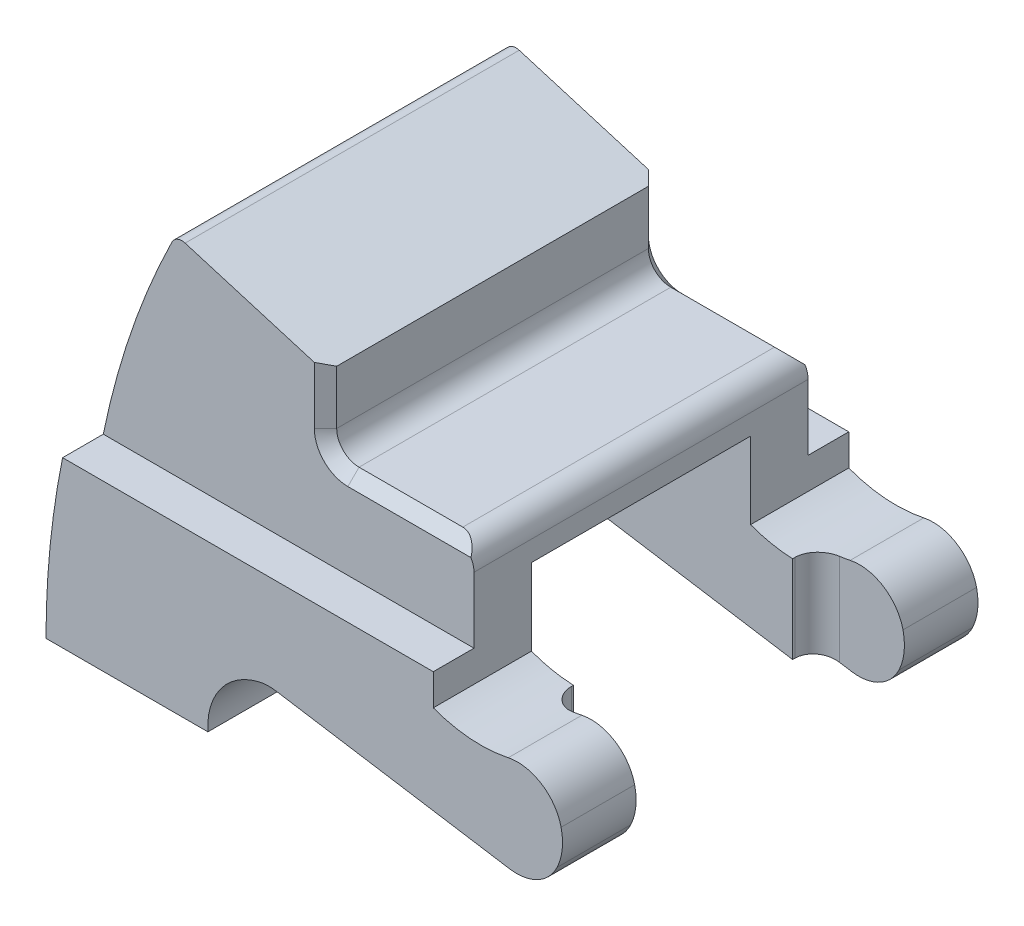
ISO-10303-21;
HEADER;
FILE_DESCRIPTION(('STEP AP214'),'2;1');
FILE_NAME('part.step','',(''),(''),'','','');
FILE_SCHEMA(('AUTOMOTIVE_DESIGN { 1 0 10303 214 1 1 1 1 }'));
ENDSEC;
DATA;
#1=APPLICATION_CONTEXT('core data for automotive mechanical design processes');
#2=APPLICATION_PROTOCOL_DEFINITION('international standard','automotive_design',2000,#1);
#3=PRODUCT_CONTEXT('',#1,'mechanical');
#4=PRODUCT('Part','Part','',(#3));
#5=PRODUCT_RELATED_PRODUCT_CATEGORY('part','',(#4));
#6=PRODUCT_DEFINITION_FORMATION('','',#4);
#7=PRODUCT_DEFINITION_CONTEXT('part definition',#1,'design');
#8=PRODUCT_DEFINITION('design','',#6,#7);
#9=PRODUCT_DEFINITION_SHAPE('','',#8);
#10=(LENGTH_UNIT() NAMED_UNIT(*) SI_UNIT(.MILLI.,.METRE.));
#11=(NAMED_UNIT(*) PLANE_ANGLE_UNIT() SI_UNIT($,.RADIAN.));
#12=(NAMED_UNIT(*) SI_UNIT($,.STERADIAN.) SOLID_ANGLE_UNIT());
#13=UNCERTAINTY_MEASURE_WITH_UNIT(LENGTH_MEASURE(1.E-05),#10,'distance_accuracy_value','');
#14=(GEOMETRIC_REPRESENTATION_CONTEXT(3) GLOBAL_UNCERTAINTY_ASSIGNED_CONTEXT((#13)) GLOBAL_UNIT_ASSIGNED_CONTEXT((#10,
#11,#12)) REPRESENTATION_CONTEXT('',''));
#15=CARTESIAN_POINT('',(0.,0.,0.));
#16=DIRECTION('',(0.,0.,1.));
#17=DIRECTION('',(1.,0.,0.));
#18=AXIS2_PLACEMENT_3D('',#15,#16,#17);
#19=CARTESIAN_POINT('',(23.5966,11.938,6.223));
#20=DIRECTION('',(0.,-1.,0.));
#21=DIRECTION('',(0.,0.,-1.));
#22=AXIS2_PLACEMENT_3D('',#19,#20,#21);
#23=PLANE('',#22);
#24=DIRECTION('',(-1.,0.,0.));
#25=VECTOR('',#24,1.);
#26=CARTESIAN_POINT('',(23.5966,11.938,6.223));
#27=LINE('',#26,#25);
#28=CARTESIAN_POINT('',(21.9964,11.938,6.223));
#29=VERTEX_POINT('',#28);
#30=CARTESIAN_POINT('',(17.3377752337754,11.938,6.223));
#31=VERTEX_POINT('',#30);
#32=EDGE_CURVE('E381',#29,#31,#27,.T.);
#33=ORIENTED_EDGE('',*,*,#32,.T.);
#34=DIRECTION('',(0.,0.,-1.));
#35=VECTOR('',#34,1.);
#36=CARTESIAN_POINT('',(17.3377752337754,11.938,6.223));
#37=LINE('',#36,#35);
#38=CARTESIAN_POINT('',(17.3377752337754,11.938,-6.223));
#39=VERTEX_POINT('',#38);
#40=EDGE_CURVE('E336',#31,#39,#37,.T.);
#41=ORIENTED_EDGE('',*,*,#40,.T.);
#42=DIRECTION('',(-1.,0.,0.));
#43=VECTOR('',#42,1.);
#44=CARTESIAN_POINT('',(23.5966,11.938,-6.223));
#45=LINE('',#44,#43);
#46=CARTESIAN_POINT('',(21.9964,11.938,-6.223));
#47=VERTEX_POINT('',#46);
#48=EDGE_CURVE('E317',#47,#39,#45,.T.);
#49=ORIENTED_EDGE('',*,*,#48,.F.);
#50=DIRECTION('',(0.,0.,1.));
#51=VECTOR('',#50,1.);
#52=CARTESIAN_POINT('',(21.9964,11.938,11.7983));
#53=LINE('',#52,#51);
#54=EDGE_CURVE('E607',#47,#29,#53,.T.);
#55=ORIENTED_EDGE('',*,*,#54,.T.);
#56=EDGE_LOOP('',(#33,#41,#49,#55));
#57=FACE_BOUND('',#56,.T.);
#58=ADVANCED_FACE('F33',(#57),#23,.T.);
#59=CARTESIAN_POINT('',(26.3332083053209,1.82862958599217,11.7983));
#60=DIRECTION('',(0.157323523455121,0.987547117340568,0.));
#61=DIRECTION('',(-0.987547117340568,0.157323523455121,0.));
#62=AXIS2_PLACEMENT_3D('',#59,#60,#61);
#63=PLANE('',#62);
#64=DIRECTION('',(0.,0.,-1.));
#65=VECTOR('',#64,1.);
#66=CARTESIAN_POINT('',(24.384,2.13915281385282,11.7983));
#67=LINE('',#66,#65);
#68=CARTESIAN_POINT('',(24.384,2.13915281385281,-6.223));
#69=VERTEX_POINT('',#68);
#70=CARTESIAN_POINT('',(24.384,2.13915281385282,-6.34999999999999));
#71=VERTEX_POINT('',#70);
#72=EDGE_CURVE('E379',#69,#71,#67,.T.);
#73=ORIENTED_EDGE('',*,*,#72,.F.);
#74=DIRECTION('',(0.987547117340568,-0.157323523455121,0.));
#75=VECTOR('',#74,1.);
#76=CARTESIAN_POINT('',(26.3332083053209,1.82862958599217,-6.223));
#77=LINE('',#76,#75);
#78=CARTESIAN_POINT('',(13.060965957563,3.94299546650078,-6.223));
#79=VERTEX_POINT('',#78);
#80=EDGE_CURVE('E392',#79,#69,#77,.T.);
#81=ORIENTED_EDGE('',*,*,#80,.F.);
#82=DIRECTION('',(0.,0.,-1.));
#83=VECTOR('',#82,1.);
#84=CARTESIAN_POINT('',(13.060965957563,3.94299546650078,11.7983));
#85=LINE('',#84,#83);
#86=CARTESIAN_POINT('',(13.060965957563,3.94299546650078,-11.7983));
#87=VERTEX_POINT('',#86);
#88=EDGE_CURVE('E526',#79,#87,#85,.T.);
#89=ORIENTED_EDGE('',*,*,#88,.T.);
#90=DIRECTION('',(0.987547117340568,-0.157323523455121,0.));
#91=VECTOR('',#90,1.);
#92=CARTESIAN_POINT('',(26.3332083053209,1.82862958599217,-11.7983));
#93=LINE('',#92,#91);
#94=CARTESIAN_POINT('',(26.3332083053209,1.82862958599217,-11.7983));
#95=VERTEX_POINT('',#94);
#96=EDGE_CURVE('E475',#87,#95,#93,.T.);
#97=ORIENTED_EDGE('',*,*,#96,.T.);
#98=DIRECTION('',(0.,0.,-1.));
#99=VECTOR('',#98,1.);
#100=CARTESIAN_POINT('',(26.3332083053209,1.82862958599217,11.7983));
#101=LINE('',#100,#99);
#102=CARTESIAN_POINT('',(26.3332083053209,1.82862958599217,-7.62));
#103=VERTEX_POINT('',#102);
#104=EDGE_CURVE('E522',#103,#95,#101,.T.);
#105=ORIENTED_EDGE('',*,*,#104,.F.);
#106=DIRECTION('',(0.987547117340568,-0.157323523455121,0.));
#107=VECTOR('',#106,1.);
#108=CARTESIAN_POINT('',(26.3332083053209,1.82862958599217,-7.62));
#109=LINE('',#108,#107);
#110=CARTESIAN_POINT('',(25.654,1.93683246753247,-7.62));
#111=VERTEX_POINT('',#110);
#112=EDGE_CURVE('E370',#111,#103,#109,.T.);
#113=ORIENTED_EDGE('',*,*,#112,.F.);
#114=CARTESIAN_POINT('',(25.654,1.93683246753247,-6.35));
#115=DIRECTION('',(0.157323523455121,0.987547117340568,0.));
#116=DIRECTION('',(-0.987547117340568,0.157323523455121,0.));
#117=AXIS2_PLACEMENT_3D('',#114,#115,#116);
#118=ELLIPSE('',#117,1.2860145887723,1.27);
#119=EDGE_CURVE('E377',#71,#111,#118,.F.);
#120=ORIENTED_EDGE('',*,*,#119,.F.);
#121=EDGE_LOOP('',(#73,#81,#89,#97,#105,#113,#120));
#122=FACE_BOUND('',#121,.T.);
#123=ADVANCED_FACE('F656',(#122),#63,.F.);
#124=DIRECTION('',(-0.987547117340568,0.157323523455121,0.));
#125=VECTOR('',#124,1.);
#126=CARTESIAN_POINT('',(26.3332083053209,1.82862958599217,7.62));
#127=LINE('',#126,#125);
#128=CARTESIAN_POINT('',(26.3332083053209,1.82862958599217,7.62));
#129=VERTEX_POINT('',#128);
#130=CARTESIAN_POINT('',(25.654,1.93683246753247,7.62));
#131=VERTEX_POINT('',#130);
#132=EDGE_CURVE('E362',#129,#131,#127,.T.);
#133=ORIENTED_EDGE('',*,*,#132,.F.);
#134=CARTESIAN_POINT('',(26.3332083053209,1.82862958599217,11.7983));
#135=VERTEX_POINT('',#134);
#136=EDGE_CURVE('E523',#135,#129,#101,.T.);
#137=ORIENTED_EDGE('',*,*,#136,.F.);
#138=DIRECTION('',(0.987547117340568,-0.157323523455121,0.));
#139=VECTOR('',#138,1.);
#140=CARTESIAN_POINT('',(26.3332083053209,1.82862958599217,11.7983));
#141=LINE('',#140,#139);
#142=CARTESIAN_POINT('',(13.060965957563,3.94299546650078,11.7983));
#143=VERTEX_POINT('',#142);
#144=EDGE_CURVE('E450',#143,#135,#141,.T.);
#145=ORIENTED_EDGE('',*,*,#144,.F.);
#146=CARTESIAN_POINT('',(13.060965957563,3.94299546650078,6.223));
#147=VERTEX_POINT('',#146);
#148=EDGE_CURVE('E527',#143,#147,#85,.T.);
#149=ORIENTED_EDGE('',*,*,#148,.T.);
#150=DIRECTION('',(-0.987547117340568,0.157323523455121,0.));
#151=VECTOR('',#150,1.);
#152=CARTESIAN_POINT('',(26.3332083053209,1.82862958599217,6.223));
#153=LINE('',#152,#151);
#154=CARTESIAN_POINT('',(24.384,2.13915281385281,6.223));
#155=VERTEX_POINT('',#154);
#156=EDGE_CURVE('E402',#155,#147,#153,.T.);
#157=ORIENTED_EDGE('',*,*,#156,.F.);
#158=DIRECTION('',(0.,0.,-1.));
#159=VECTOR('',#158,1.);
#160=CARTESIAN_POINT('',(24.384,2.13915281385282,11.7983));
#161=LINE('',#160,#159);
#162=CARTESIAN_POINT('',(24.384,2.13915281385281,6.34999999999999));
#163=VERTEX_POINT('',#162);
#164=EDGE_CURVE('E372',#163,#155,#161,.T.);
#165=ORIENTED_EDGE('',*,*,#164,.F.);
#166=CARTESIAN_POINT('',(25.654,1.93683246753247,6.35));
#167=DIRECTION('',(0.157323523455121,0.987547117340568,0.));
#168=DIRECTION('',(-0.987547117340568,0.157323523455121,0.));
#169=AXIS2_PLACEMENT_3D('',#166,#167,#168);
#170=ELLIPSE('',#169,1.2860145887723,1.27);
#171=EDGE_CURVE('E375',#131,#163,#170,.F.);
#172=ORIENTED_EDGE('',*,*,#171,.F.);
#173=EDGE_LOOP('',(#133,#137,#145,#149,#157,#165,#172));
#174=FACE_BOUND('',#173,.T.);
#175=ADVANCED_FACE('F742',(#174),#63,.F.);
#176=CARTESIAN_POINT('',(24.68245,14.7127860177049,11.7983));
#177=DIRECTION('',(0.,0.,-1.));
#178=DIRECTION('',(-1.,0.,0.));
#179=AXIS2_PLACEMENT_3D('',#176,#177,#178);
#180=CYLINDRICAL_SURFACE('',#179,7.62);
#181=CARTESIAN_POINT('',(24.68245,14.7127860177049,-6.22299999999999));
#182=DIRECTION('',(0.,0.,1.));
#183=DIRECTION('',(1.,0.,0.));
#184=AXIS2_PLACEMENT_3D('',#181,#182,#183);
#185=CIRCLE('',#184,7.62);
#186=CARTESIAN_POINT('',(24.384,7.09863290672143,-6.223));
#187=VERTEX_POINT('',#186);
#188=CARTESIAN_POINT('',(21.9964,7.5819,-6.22299999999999));
#189=VERTEX_POINT('',#188);
#190=EDGE_CURVE('E603',#187,#189,#185,.F.);
#191=ORIENTED_EDGE('',*,*,#190,.F.);
#192=DIRECTION('',(0.,0.,-1.));
#193=VECTOR('',#192,1.);
#194=CARTESIAN_POINT('',(24.384,7.09863290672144,11.7983));
#195=LINE('',#194,#193);
#196=CARTESIAN_POINT('',(24.384,7.09863290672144,-6.34999999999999));
#197=VERTEX_POINT('',#196);
#198=EDGE_CURVE('E11',#197,#187,#195,.F.);
#199=ORIENTED_EDGE('',*,*,#198,.F.);
#200=CARTESIAN_POINT('',(25.654,7.15497611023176,-7.62));
#201=CARTESIAN_POINT('',(25.6188086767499,7.15045095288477,-7.61999988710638));
#202=CARTESIAN_POINT('',(25.5836011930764,7.14617658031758,-7.61853627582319));
#203=CARTESIAN_POINT('',(25.5133713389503,7.1381430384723,-7.61268228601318));
#204=CARTESIAN_POINT('',(25.4783489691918,7.13438387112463,-7.60829189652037));
#205=CARTESIAN_POINT('',(25.3740049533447,7.12391160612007,-7.59075090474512));
#206=CARTESIAN_POINT('',(25.305284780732,7.11798820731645,-7.5732304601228));
#207=CARTESIAN_POINT('',(25.1715713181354,7.10820378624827,-7.52693616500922));
#208=CARTESIAN_POINT('',(25.1065807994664,7.10434428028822,-7.49815406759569));
#209=CARTESIAN_POINT('',(24.9822489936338,7.09843150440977,-7.43012419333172));
#210=CARTESIAN_POINT('',(24.9229064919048,7.0963778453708,-7.39087867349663));
#211=CARTESIAN_POINT('',(24.8117191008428,7.09367966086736,-7.30313561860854));
#212=CARTESIAN_POINT('',(24.7598560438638,7.09303166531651,-7.25466118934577));
#213=CARTESIAN_POINT('',(24.6649034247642,7.09265792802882,-7.14974636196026));
#214=CARTESIAN_POINT('',(24.621815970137,7.09293240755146,-7.09330405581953));
#215=CARTESIAN_POINT('',(24.5453968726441,7.09392183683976,-6.97367457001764));
#216=CARTESIAN_POINT('',(24.5121276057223,7.09463951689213,-6.91044760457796));
#217=CARTESIAN_POINT('',(24.4566540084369,7.09608134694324,-6.77932880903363));
#218=CARTESIAN_POINT('',(24.4344439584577,7.09680549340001,-6.71143941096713));
#219=CARTESIAN_POINT('',(24.4067559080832,7.09776649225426,-6.59434588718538));
#220=CARTESIAN_POINT('',(24.3982295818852,7.09808475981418,-6.54584060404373));
#221=CARTESIAN_POINT('',(24.3868510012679,7.09852114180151,-6.44823015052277));
#222=CARTESIAN_POINT('',(24.383991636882,7.09863950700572,-6.39912580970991));
#223=CARTESIAN_POINT('',(24.384,7.09863290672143,-6.34999999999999));
#224=B_SPLINE_CURVE_WITH_KNOTS('',3,(#200,#201,#202,#203,#204,#205,#206,#207,#208,#209,#210,
#211,#212,#213,#214,#215,#216,#217,#218,#219,#220,#221,#222,#223),.UNSPECIFIED.,.F.,.F.,(4,2,2,
2,2,2,2,2,2,2,2,4),(0.,0.106379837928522,0.21276007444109,0.425157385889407,0.637710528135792,
0.850217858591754,1.06219998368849,1.27423295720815,1.48758534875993,1.70082728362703,
1.84826513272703,1.99551788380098),.UNSPECIFIED.);
#225=CARTESIAN_POINT('',(25.654,7.15497611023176,-7.62));
#226=VERTEX_POINT('',#225);
#227=EDGE_CURVE('E41',#226,#197,#224,.T.);
#228=ORIENTED_EDGE('',*,*,#227,.F.);
#229=CARTESIAN_POINT('',(24.68245,14.7127860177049,-7.62));
#230=DIRECTION('',(0.,0.,1.));
#231=DIRECTION('',(1.,0.,0.));
#232=AXIS2_PLACEMENT_3D('',#229,#230,#231);
#233=CIRCLE('',#232,7.62);
#234=CARTESIAN_POINT('',(26.2557629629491,7.25697711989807,-7.62));
#235=VERTEX_POINT('',#234);
#236=EDGE_CURVE('E364',#235,#226,#233,.F.);
#237=ORIENTED_EDGE('',*,*,#236,.F.);
#238=DIRECTION('',(0.,0.,-1.));
#239=VECTOR('',#238,1.);
#240=CARTESIAN_POINT('',(26.2557629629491,7.25697711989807,11.7983));
#241=LINE('',#240,#239);
#242=CARTESIAN_POINT('',(26.2557629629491,7.25697711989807,-11.7983));
#243=VERTEX_POINT('',#242);
#244=EDGE_CURVE('E510',#235,#243,#241,.T.);
#245=ORIENTED_EDGE('',*,*,#244,.T.);
#246=CARTESIAN_POINT('',(24.68245,14.7127860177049,-11.7983));
#247=DIRECTION('',(0.,0.,-1.));
#248=DIRECTION('',(1.,0.,0.));
#249=AXIS2_PLACEMENT_3D('',#246,#247,#248);
#250=CIRCLE('',#249,7.62);
#251=CARTESIAN_POINT('',(21.9964,7.5819,-11.7983));
#252=VERTEX_POINT('',#251);
#253=EDGE_CURVE('E487',#243,#252,#250,.T.);
#254=ORIENTED_EDGE('',*,*,#253,.T.);
#255=DIRECTION('',(0.,0.,-1.));
#256=VECTOR('',#255,1.);
#257=CARTESIAN_POINT('',(21.9964,7.5819,11.7983));
#258=LINE('',#257,#256);
#259=EDGE_CURVE('E506',#189,#252,#258,.T.);
#260=ORIENTED_EDGE('',*,*,#259,.F.);
#261=EDGE_LOOP('',(#191,#199,#228,#237,#245,#254,#260));
#262=FACE_BOUND('',#261,.T.);
#263=ADVANCED_FACE('F626',(#262),#180,.F.);
#264=CARTESIAN_POINT('',(24.68245,14.7127860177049,7.62));
#265=DIRECTION('',(0.,0.,-1.));
#266=DIRECTION('',(-1.,0.,0.));
#267=AXIS2_PLACEMENT_3D('',#264,#265,#266);
#268=CIRCLE('',#267,7.62);
#269=CARTESIAN_POINT('',(25.654,7.15497611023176,7.62));
#270=VERTEX_POINT('',#269);
#271=CARTESIAN_POINT('',(26.2557629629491,7.25697711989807,7.62));
#272=VERTEX_POINT('',#271);
#273=EDGE_CURVE('E356',#270,#272,#268,.F.);
#274=ORIENTED_EDGE('',*,*,#273,.F.);
#275=CARTESIAN_POINT('',(24.384,7.09863290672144,6.34999999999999));
#276=CARTESIAN_POINT('',(24.3840002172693,7.09863434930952,6.38572660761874));
#277=CARTESIAN_POINT('',(24.3855084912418,7.09857361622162,6.42143606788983));
#278=CARTESIAN_POINT('',(24.3915254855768,7.09834077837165,6.49259895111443));
#279=CARTESIAN_POINT('',(24.396034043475,7.09816867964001,6.52805238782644));
#280=CARTESIAN_POINT('',(24.4140167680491,7.09750553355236,6.63358380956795));
#281=CARTESIAN_POINT('',(24.4319481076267,7.09686755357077,6.70295417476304));
#282=CARTESIAN_POINT('',(24.4791983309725,7.09546097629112,6.83769617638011));
#283=CARTESIAN_POINT('',(24.5085224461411,7.09469231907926,6.90306595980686));
#284=CARTESIAN_POINT('',(24.5777265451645,7.09342738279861,7.02795900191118));
#285=CARTESIAN_POINT('',(24.6176050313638,7.09293106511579,7.08748308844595));
#286=CARTESIAN_POINT('',(24.7067896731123,7.09269479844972,7.19899415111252));
#287=CARTESIAN_POINT('',(24.7560960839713,7.09295486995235,7.25098092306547));
#288=CARTESIAN_POINT('',(24.8627330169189,7.09473279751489,7.34593807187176));
#289=CARTESIAN_POINT('',(24.9200643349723,7.09625077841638,7.38890755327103));
#290=CARTESIAN_POINT('',(25.0407959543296,7.10097822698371,7.46441887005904));
#291=CARTESIAN_POINT('',(25.1041676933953,7.10418002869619,7.49700689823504));
#292=CARTESIAN_POINT('',(25.2353402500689,7.11258734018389,7.55110364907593));
#293=CARTESIAN_POINT('',(25.3031388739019,7.11779186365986,7.57261781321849));
#294=CARTESIAN_POINT('',(25.4184490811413,7.12827060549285,7.59887078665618));
#295=CARTESIAN_POINT('',(25.4653144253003,7.1329611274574,7.60679802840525));
#296=CARTESIAN_POINT('',(25.5594672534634,7.14327452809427,7.61736269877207));
#297=CARTESIAN_POINT('',(25.6067540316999,7.1488960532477,7.62000773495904));
#298=CARTESIAN_POINT('',(25.654,7.15497611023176,7.62));
#299=B_SPLINE_CURVE_WITH_KNOTS('',3,(#275,#276,#277,#278,#279,#280,#281,#282,#283,#284,#285,
#286,#287,#288,#289,#290,#291,#292,#293,#294,#295,#296,#297,#298),.UNSPECIFIED.,.F.,.F.,(4,2,2,
2,2,2,2,2,2,2,2,4),(0.,0.107113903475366,0.214222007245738,0.428079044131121,0.642034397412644,
0.855959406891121,1.06989021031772,1.28384224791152,1.49682854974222,1.70971009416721,
1.85271072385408,1.99550525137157),.UNSPECIFIED.);
#300=CARTESIAN_POINT('',(24.384,7.09863290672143,6.34999999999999));
#301=VERTEX_POINT('',#300);
#302=EDGE_CURVE('E616',#301,#270,#299,.T.);
#303=ORIENTED_EDGE('',*,*,#302,.F.);
#304=DIRECTION('',(0.,0.,-1.));
#305=VECTOR('',#304,1.);
#306=CARTESIAN_POINT('',(24.384,7.09863290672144,11.7983));
#307=LINE('',#306,#305);
#308=CARTESIAN_POINT('',(24.384,7.09863290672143,6.223));
#309=VERTEX_POINT('',#308);
#310=EDGE_CURVE('E614',#309,#301,#307,.F.);
#311=ORIENTED_EDGE('',*,*,#310,.F.);
#312=CARTESIAN_POINT('',(24.68245,14.7127860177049,6.223));
#313=DIRECTION('',(0.,0.,-1.));
#314=DIRECTION('',(-1.,0.,0.));
#315=AXIS2_PLACEMENT_3D('',#312,#313,#314);
#316=CIRCLE('',#315,7.62);
#317=CARTESIAN_POINT('',(21.9964,7.5819,6.223));
#318=VERTEX_POINT('',#317);
#319=EDGE_CURVE('E605',#318,#309,#316,.F.);
#320=ORIENTED_EDGE('',*,*,#319,.F.);
#321=CARTESIAN_POINT('',(21.9964,7.5819,11.7983));
#322=VERTEX_POINT('',#321);
#323=EDGE_CURVE('E507',#322,#318,#258,.T.);
#324=ORIENTED_EDGE('',*,*,#323,.F.);
#325=CARTESIAN_POINT('',(24.68245,14.7127860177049,11.7983));
#326=DIRECTION('',(0.,0.,-1.));
#327=DIRECTION('',(1.,0.,0.));
#328=AXIS2_PLACEMENT_3D('',#325,#326,#327);
#329=CIRCLE('',#328,7.62);
#330=CARTESIAN_POINT('',(26.2557629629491,7.25697711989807,11.7983));
#331=VERTEX_POINT('',#330);
#332=EDGE_CURVE('E458',#331,#322,#329,.T.);
#333=ORIENTED_EDGE('',*,*,#332,.F.);
#334=EDGE_CURVE('E511',#331,#272,#241,.T.);
#335=ORIENTED_EDGE('',*,*,#334,.T.);
#336=EDGE_LOOP('',(#274,#303,#311,#320,#324,#333,#335));
#337=FACE_BOUND('',#336,.T.);
#338=ADVANCED_FACE('F732',(#337),#180,.F.);
#339=CARTESIAN_POINT('',(26.7328100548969,4.33699926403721,11.7983));
#340=DIRECTION('',(0.,0.,-1.));
#341=DIRECTION('',(-1.,0.,0.));
#342=AXIS2_PLACEMENT_3D('',#339,#340,#341);
#343=CYLINDRICAL_SURFACE('',#342,2.54);
#344=CARTESIAN_POINT('',(26.7328100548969,4.33699926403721,-7.62));
#345=DIRECTION('',(0.,0.,1.));
#346=DIRECTION('',(1.,0.,0.));
#347=AXIS2_PLACEMENT_3D('',#344,#345,#346);
#348=CIRCLE('',#347,2.54);
#349=CARTESIAN_POINT('',(29.0288615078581,3.25083733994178,-7.62));
#350=VERTEX_POINT('',#349);
#351=EDGE_CURVE('E367',#103,#350,#348,.T.);
#352=ORIENTED_EDGE('',*,*,#351,.F.);
#353=ORIENTED_EDGE('',*,*,#104,.T.);
#354=CARTESIAN_POINT('',(26.7328100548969,4.33699926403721,-11.7983));
#355=DIRECTION('',(0.,0.,1.));
#356=DIRECTION('',(1.,0.,0.));
#357=AXIS2_PLACEMENT_3D('',#354,#355,#356);
#358=CIRCLE('',#357,2.54);
#359=CARTESIAN_POINT('',(29.0288615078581,3.25083733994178,-11.7983));
#360=VERTEX_POINT('',#359);
#361=EDGE_CURVE('E478',#95,#360,#358,.T.);
#362=ORIENTED_EDGE('',*,*,#361,.T.);
#363=DIRECTION('',(0.,0.,-1.));
#364=VECTOR('',#363,1.);
#365=CARTESIAN_POINT('',(29.0288615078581,3.25083733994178,11.7983));
#366=LINE('',#365,#364);
#367=EDGE_CURVE('E518',#350,#360,#366,.T.);
#368=ORIENTED_EDGE('',*,*,#367,.F.);
#369=EDGE_LOOP('',(#352,#353,#362,#368));
#370=FACE_BOUND('',#369,.T.);
#371=ADVANCED_FACE('F865',(#370),#343,.T.);
#372=CARTESIAN_POINT('',(26.7328100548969,4.33699926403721,7.62));
#373=DIRECTION('',(0.,0.,-1.));
#374=DIRECTION('',(-1.,0.,0.));
#375=AXIS2_PLACEMENT_3D('',#372,#373,#374);
#376=CIRCLE('',#375,2.54);
#377=CARTESIAN_POINT('',(29.0288615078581,3.25083733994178,7.62));
#378=VERTEX_POINT('',#377);
#379=EDGE_CURVE('E359',#378,#129,#376,.T.);
#380=ORIENTED_EDGE('',*,*,#379,.F.);
#381=CARTESIAN_POINT('',(29.0288615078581,3.25083733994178,11.7983));
#382=VERTEX_POINT('',#381);
#383=EDGE_CURVE('E519',#382,#378,#366,.T.);
#384=ORIENTED_EDGE('',*,*,#383,.F.);
#385=CARTESIAN_POINT('',(26.7328100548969,4.33699926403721,11.7983));
#386=DIRECTION('',(0.,0.,1.));
#387=DIRECTION('',(1.,0.,0.));
#388=AXIS2_PLACEMENT_3D('',#385,#386,#387);
#389=CIRCLE('',#388,2.54);
#390=EDGE_CURVE('E452',#135,#382,#389,.T.);
#391=ORIENTED_EDGE('',*,*,#390,.F.);
#392=ORIENTED_EDGE('',*,*,#136,.T.);
#393=EDGE_LOOP('',(#380,#384,#391,#392));
#394=FACE_BOUND('',#393,.T.);
#395=ADVANCED_FACE('F850',(#394),#343,.T.);
#396=CARTESIAN_POINT('',(26.1286522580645,4.6228,11.7983));
#397=DIRECTION('',(0.,0.,-1.));
#398=DIRECTION('',(-1.,0.,0.));
#399=AXIS2_PLACEMENT_3D('',#396,#397,#398);
#400=CYLINDRICAL_SURFACE('',#399,3.20834774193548);
#401=DIRECTION('',(0.,0.,-1.));
#402=VECTOR('',#401,1.);
#403=CARTESIAN_POINT('',(29.2563559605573,5.3376180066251,11.7983));
#404=LINE('',#403,#402);
#405=CARTESIAN_POINT('',(29.2563559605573,5.3376180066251,-7.62));
#406=VERTEX_POINT('',#405);
#407=CARTESIAN_POINT('',(29.2563559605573,5.3376180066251,-11.7983));
#408=VERTEX_POINT('',#407);
#409=EDGE_CURVE('E514',#406,#408,#404,.T.);
#410=ORIENTED_EDGE('',*,*,#409,.F.);
#411=CARTESIAN_POINT('',(26.1286522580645,4.6228,-7.62));
#412=DIRECTION('',(0.,0.,1.));
#413=DIRECTION('',(1.,0.,0.));
#414=AXIS2_PLACEMENT_3D('',#411,#412,#413);
#415=CIRCLE('',#414,3.20834774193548);
#416=EDGE_CURVE('E365',#350,#406,#415,.T.);
#417=ORIENTED_EDGE('',*,*,#416,.F.);
#418=ORIENTED_EDGE('',*,*,#367,.T.);
#419=CARTESIAN_POINT('',(26.1286522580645,4.6228,-11.7983));
#420=DIRECTION('',(0.,0.,1.));
#421=DIRECTION('',(-1.,0.,0.));
#422=AXIS2_PLACEMENT_3D('',#419,#420,#421);
#423=CIRCLE('',#422,3.20834774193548);
#424=EDGE_CURVE('E481',#360,#408,#423,.T.);
#425=ORIENTED_EDGE('',*,*,#424,.T.);
#426=EDGE_LOOP('',(#410,#417,#418,#425));
#427=FACE_BOUND('',#426,.T.);
#428=ADVANCED_FACE('F856',(#427),#400,.T.);
#429=CARTESIAN_POINT('',(26.1286522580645,4.6228,7.62));
#430=DIRECTION('',(0.,0.,-1.));
#431=DIRECTION('',(-1.,0.,0.));
#432=AXIS2_PLACEMENT_3D('',#429,#430,#431);
#433=CIRCLE('',#432,3.20834774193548);
#434=CARTESIAN_POINT('',(29.2563559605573,5.3376180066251,7.62));
#435=VERTEX_POINT('',#434);
#436=EDGE_CURVE('E357',#435,#378,#433,.T.);
#437=ORIENTED_EDGE('',*,*,#436,.F.);
#438=CARTESIAN_POINT('',(29.2563559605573,5.3376180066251,11.7983));
#439=VERTEX_POINT('',#438);
#440=EDGE_CURVE('E515',#439,#435,#404,.T.);
#441=ORIENTED_EDGE('',*,*,#440,.F.);
#442=CARTESIAN_POINT('',(26.1286522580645,4.6228,11.7983));
#443=DIRECTION('',(0.,0.,1.));
#444=DIRECTION('',(-1.,0.,0.));
#445=AXIS2_PLACEMENT_3D('',#442,#443,#444);
#446=CIRCLE('',#445,3.20834774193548);
#447=EDGE_CURVE('E454',#382,#439,#446,.T.);
#448=ORIENTED_EDGE('',*,*,#447,.F.);
#449=ORIENTED_EDGE('',*,*,#383,.T.);
#450=EDGE_LOOP('',(#437,#441,#448,#449));
#451=FACE_BOUND('',#450,.T.);
#452=ADVANCED_FACE('F853',(#451),#400,.T.);
#453=CARTESIAN_POINT('',(26.7802006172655,4.77170748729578,11.7983));
#454=DIRECTION('',(0.,0.,-1.));
#455=DIRECTION('',(-1.,0.,0.));
#456=AXIS2_PLACEMENT_3D('',#453,#454,#455);
#457=CYLINDRICAL_SURFACE('',#456,2.54);
#458=CARTESIAN_POINT('',(26.7802006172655,4.77170748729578,-7.62));
#459=DIRECTION('',(0.,0.,1.));
#460=DIRECTION('',(1.,0.,0.));
#461=AXIS2_PLACEMENT_3D('',#458,#459,#460);
#462=CIRCLE('',#461,2.54);
#463=EDGE_CURVE('E612',#406,#235,#462,.T.);
#464=ORIENTED_EDGE('',*,*,#463,.F.);
#465=ORIENTED_EDGE('',*,*,#409,.T.);
#466=CARTESIAN_POINT('',(26.7802006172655,4.77170748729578,-11.7983));
#467=DIRECTION('',(0.,0.,1.));
#468=DIRECTION('',(-1.,0.,0.));
#469=AXIS2_PLACEMENT_3D('',#466,#467,#468);
#470=CIRCLE('',#469,2.54);
#471=EDGE_CURVE('E484',#408,#243,#470,.T.);
#472=ORIENTED_EDGE('',*,*,#471,.T.);
#473=ORIENTED_EDGE('',*,*,#244,.F.);
#474=EDGE_LOOP('',(#464,#465,#472,#473));
#475=FACE_BOUND('',#474,.T.);
#476=ADVANCED_FACE('F855',(#475),#457,.T.);
#477=CARTESIAN_POINT('',(26.7802006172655,4.77170748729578,7.62));
#478=DIRECTION('',(0.,0.,-1.));
#479=DIRECTION('',(-1.,0.,0.));
#480=AXIS2_PLACEMENT_3D('',#477,#478,#479);
#481=CIRCLE('',#480,2.54);
#482=EDGE_CURVE('E609',#272,#435,#481,.T.);
#483=ORIENTED_EDGE('',*,*,#482,.F.);
#484=ORIENTED_EDGE('',*,*,#334,.F.);
#485=CARTESIAN_POINT('',(26.7802006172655,4.77170748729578,11.7983));
#486=DIRECTION('',(0.,0.,1.));
#487=DIRECTION('',(-1.,0.,0.));
#488=AXIS2_PLACEMENT_3D('',#485,#486,#487);
#489=CIRCLE('',#488,2.54);
#490=EDGE_CURVE('E456',#439,#331,#489,.T.);
#491=ORIENTED_EDGE('',*,*,#490,.F.);
#492=ORIENTED_EDGE('',*,*,#440,.T.);
#493=EDGE_LOOP('',(#483,#484,#491,#492));
#494=FACE_BOUND('',#493,.T.);
#495=ADVANCED_FACE('F719',(#494),#457,.T.);
#496=CARTESIAN_POINT('',(46.919896,0.,11.7983));
#497=DIRECTION('',(0.,0.,-1.));
#498=DIRECTION('',(-1.,0.,0.));
#499=AXIS2_PLACEMENT_3D('',#496,#497,#498);
#500=CYLINDRICAL_SURFACE('',#499,46.919896);
#501=CARTESIAN_POINT('',(46.919896,0.,-6.22299999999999));
#502=DIRECTION('',(0.,0.,1.));
#503=DIRECTION('',(1.,0.,0.));
#504=AXIS2_PLACEMENT_3D('',#501,#502,#503);
#505=CIRCLE('',#504,46.919896);
#506=CARTESIAN_POINT('',(4.26795871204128,19.5522092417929,-6.223));
#507=VERTEX_POINT('',#506);
#508=CARTESIAN_POINT('',(0.,0.,-6.223));
#509=VERTEX_POINT('',#508);
#510=EDGE_CURVE('E398',#507,#509,#505,.T.);
#511=ORIENTED_EDGE('',*,*,#510,.F.);
#512=DIRECTION('',(0.,0.,-1.));
#513=VECTOR('',#512,1.);
#514=CARTESIAN_POINT('',(4.26795871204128,19.5522092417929,23.7965141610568));
#515=LINE('',#514,#513);
#516=CARTESIAN_POINT('',(4.26795871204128,19.5522092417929,6.223));
#517=VERTEX_POINT('',#516);
#518=EDGE_CURVE('E327',#517,#507,#515,.T.);
#519=ORIENTED_EDGE('',*,*,#518,.F.);
#520=CARTESIAN_POINT('',(46.919896,0.,6.223));
#521=DIRECTION('',(0.,0.,-1.));
#522=DIRECTION('',(-1.,0.,0.));
#523=AXIS2_PLACEMENT_3D('',#520,#521,#522);
#524=CIRCLE('',#523,46.919896);
#525=CARTESIAN_POINT('',(0.,0.,6.223));
#526=VERTEX_POINT('',#525);
#527=EDGE_CURVE('E408',#526,#517,#524,.T.);
#528=ORIENTED_EDGE('',*,*,#527,.F.);
#529=DIRECTION('',(0.,0.,-1.));
#530=VECTOR('',#529,1.);
#531=CARTESIAN_POINT('',(0.,0.,11.7983));
#532=LINE('',#531,#530);
#533=CARTESIAN_POINT('',(0.,0.,11.7983));
#534=VERTEX_POINT('',#533);
#535=EDGE_CURVE('E539',#534,#526,#532,.T.);
#536=ORIENTED_EDGE('',*,*,#535,.F.);
#537=CARTESIAN_POINT('',(46.919896,0.,11.7983));
#538=DIRECTION('',(0.,0.,1.));
#539=DIRECTION('',(1.,0.,0.));
#540=AXIS2_PLACEMENT_3D('',#537,#538,#539);
#541=CIRCLE('',#540,46.919896);
#542=CARTESIAN_POINT('',(0.94306582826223,9.3599,11.7983));
#543=VERTEX_POINT('',#542);
#544=EDGE_CURVE('E441',#543,#534,#541,.T.);
#545=ORIENTED_EDGE('',*,*,#544,.F.);
#546=DIRECTION('',(0.,0.,-1.));
#547=VECTOR('',#546,1.);
#548=CARTESIAN_POINT('',(0.943065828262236,9.3599,11.7983));
#549=LINE('',#548,#547);
#550=CARTESIAN_POINT('',(0.94306582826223,9.3599,9.4869));
#551=VERTEX_POINT('',#550);
#552=EDGE_CURVE('E431',#551,#543,#549,.F.);
#553=ORIENTED_EDGE('',*,*,#552,.F.);
#554=CARTESIAN_POINT('',(46.919896,0.,9.4869));
#555=DIRECTION('',(0.,0.,1.));
#556=DIRECTION('',(0.,-1.,0.));
#557=AXIS2_PLACEMENT_3D('',#554,#555,#556);
#558=CIRCLE('',#557,46.919896);
#559=CARTESIAN_POINT('',(4.83958706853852,20.7538970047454,9.4869));
#560=VERTEX_POINT('',#559);
#561=EDGE_CURVE('E438',#560,#551,#558,.T.);
#562=ORIENTED_EDGE('',*,*,#561,.F.);
#563=DIRECTION('',(0.,0.,-1.));
#564=VECTOR('',#563,1.);
#565=CARTESIAN_POINT('',(4.83958706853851,20.7538970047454,11.7983));
#566=LINE('',#565,#564);
#567=CARTESIAN_POINT('',(4.83958706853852,20.7538970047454,-9.48689999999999));
#568=VERTEX_POINT('',#567);
#569=EDGE_CURVE('E586',#560,#568,#566,.T.);
#570=ORIENTED_EDGE('',*,*,#569,.T.);
#571=CARTESIAN_POINT('',(46.919896,0.,-9.4869));
#572=DIRECTION('',(0.,0.,-1.));
#573=DIRECTION('',(0.,1.,0.));
#574=AXIS2_PLACEMENT_3D('',#571,#572,#573);
#575=CIRCLE('',#574,46.919896);
#576=CARTESIAN_POINT('',(0.943065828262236,9.3599,-9.4869));
#577=VERTEX_POINT('',#576);
#578=EDGE_CURVE('E423',#577,#568,#575,.T.);
#579=ORIENTED_EDGE('',*,*,#578,.F.);
#580=DIRECTION('',(0.,0.,-1.));
#581=VECTOR('',#580,1.);
#582=CARTESIAN_POINT('',(0.943065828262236,9.3599,11.7983));
#583=LINE('',#582,#581);
#584=CARTESIAN_POINT('',(0.94306582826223,9.3599,-11.7983));
#585=VERTEX_POINT('',#584);
#586=EDGE_CURVE('E417',#585,#577,#583,.F.);
#587=ORIENTED_EDGE('',*,*,#586,.F.);
#588=CARTESIAN_POINT('',(46.919896,0.,-11.7983));
#589=DIRECTION('',(0.,0.,1.));
#590=DIRECTION('',(1.,0.,0.));
#591=AXIS2_PLACEMENT_3D('',#588,#589,#590);
#592=CIRCLE('',#591,46.919896);
#593=CARTESIAN_POINT('',(0.,0.,-11.7983));
#594=VERTEX_POINT('',#593);
#595=EDGE_CURVE('E440',#585,#594,#592,.T.);
#596=ORIENTED_EDGE('',*,*,#595,.T.);
#597=EDGE_CURVE('E538',#509,#594,#532,.T.);
#598=ORIENTED_EDGE('',*,*,#597,.F.);
#599=EDGE_LOOP('',(#511,#519,#528,#536,#545,#553,#562,#570,#579,#587,#596,#598));
#600=FACE_BOUND('',#599,.T.);
#601=ADVANCED_FACE('F710',(#600),#500,.T.);
#602=CARTESIAN_POINT('',(21.9964,13.0937,11.7983));
#603=DIRECTION('',(-1.,0.,0.));
#604=DIRECTION('',(0.,0.,1.));
#605=AXIS2_PLACEMENT_3D('',#602,#603,#604);
#606=PLANE('',#605);
#607=DIRECTION('',(0.,-1.,0.));
#608=VECTOR('',#607,1.);
#609=CARTESIAN_POINT('',(21.9964,13.0937,6.223));
#610=LINE('',#609,#608);
#611=EDGE_CURVE('E400',#29,#318,#610,.T.);
#612=ORIENTED_EDGE('',*,*,#611,.F.);
#613=ORIENTED_EDGE('',*,*,#54,.F.);
#614=DIRECTION('',(0.,1.,0.));
#615=VECTOR('',#614,1.);
#616=CARTESIAN_POINT('',(21.9964,13.0937,-6.22299999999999));
#617=LINE('',#616,#615);
#618=EDGE_CURVE('E390',#189,#47,#617,.T.);
#619=ORIENTED_EDGE('',*,*,#618,.F.);
#620=ORIENTED_EDGE('',*,*,#259,.T.);
#621=DIRECTION('',(0.,1.,0.));
#622=VECTOR('',#621,1.);
#623=CARTESIAN_POINT('',(21.9964,13.0937,-11.7983));
#624=LINE('',#623,#622);
#625=CARTESIAN_POINT('',(21.9964,9.3599,-11.7983));
#626=VERTEX_POINT('',#625);
#627=EDGE_CURVE('E444',#252,#626,#624,.T.);
#628=ORIENTED_EDGE('',*,*,#627,.T.);
#629=DIRECTION('',(0.,0.,-1.));
#630=VECTOR('',#629,1.);
#631=CARTESIAN_POINT('',(21.9964,9.3599,11.7983));
#632=LINE('',#631,#630);
#633=CARTESIAN_POINT('',(21.9964,9.3599,-9.4869));
#634=VERTEX_POINT('',#633);
#635=EDGE_CURVE('E414',#634,#626,#632,.T.);
#636=ORIENTED_EDGE('',*,*,#635,.F.);
#637=DIRECTION('',(0.,-1.,0.));
#638=VECTOR('',#637,1.);
#639=CARTESIAN_POINT('',(21.9964,13.0937,-9.48689999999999));
#640=LINE('',#639,#638);
#641=CARTESIAN_POINT('',(21.9964,13.0937,-9.48689999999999));
#642=VERTEX_POINT('',#641);
#643=EDGE_CURVE('E421',#642,#634,#640,.T.);
#644=ORIENTED_EDGE('',*,*,#643,.F.);
#645=DIRECTION('',(0.,0.,-1.));
#646=VECTOR('',#645,1.);
#647=CARTESIAN_POINT('',(21.9964,13.0937,11.7983));
#648=LINE('',#647,#646);
#649=CARTESIAN_POINT('',(21.9964,13.0937,9.4869));
#650=VERTEX_POINT('',#649);
#651=EDGE_CURVE('E503',#650,#642,#648,.T.);
#652=ORIENTED_EDGE('',*,*,#651,.F.);
#653=DIRECTION('',(0.,1.,0.));
#654=VECTOR('',#653,1.);
#655=CARTESIAN_POINT('',(21.9964,13.0937,9.4869));
#656=LINE('',#655,#654);
#657=CARTESIAN_POINT('',(21.9964,9.3599,9.4869));
#658=VERTEX_POINT('',#657);
#659=EDGE_CURVE('E436',#658,#650,#656,.T.);
#660=ORIENTED_EDGE('',*,*,#659,.F.);
#661=DIRECTION('',(0.,0.,-1.));
#662=VECTOR('',#661,1.);
#663=CARTESIAN_POINT('',(21.9964,9.3599,11.7983));
#664=LINE('',#663,#662);
#665=CARTESIAN_POINT('',(21.9964,9.3599,11.7983));
#666=VERTEX_POINT('',#665);
#667=EDGE_CURVE('E429',#666,#658,#664,.T.);
#668=ORIENTED_EDGE('',*,*,#667,.F.);
#669=DIRECTION('',(0.,1.,0.));
#670=VECTOR('',#669,1.);
#671=CARTESIAN_POINT('',(21.9964,13.0937,11.7983));
#672=LINE('',#671,#670);
#673=EDGE_CURVE('E460',#322,#666,#672,.T.);
#674=ORIENTED_EDGE('',*,*,#673,.F.);
#675=ORIENTED_EDGE('',*,*,#323,.T.);
#676=EDGE_LOOP('',(#612,#613,#619,#620,#628,#636,#644,#652,#660,#668,#674,#675));
#677=FACE_BOUND('',#676,.T.);
#678=ADVANCED_FACE('F707',(#677),#606,.F.);
#679=CARTESIAN_POINT('',(0.,0.,11.7983));
#680=DIRECTION('',(0.,1.,0.));
#681=DIRECTION('',(0.,0.,1.));
#682=AXIS2_PLACEMENT_3D('',#679,#680,#681);
#683=PLANE('',#682);
#684=DIRECTION('',(-1.,0.,0.));
#685=VECTOR('',#684,1.);
#686=CARTESIAN_POINT('',(23.5966,0.,6.223));
#687=LINE('',#686,#685);
#688=CARTESIAN_POINT('',(9.1948,0.,6.223));
#689=VERTEX_POINT('',#688);
#690=EDGE_CURVE('E388',#689,#526,#687,.T.);
#691=ORIENTED_EDGE('',*,*,#690,.F.);
#692=DIRECTION('',(0.,0.,-1.));
#693=VECTOR('',#692,1.);
#694=CARTESIAN_POINT('',(9.1948,0.,11.7983));
#695=LINE('',#694,#693);
#696=CARTESIAN_POINT('',(9.1948,0.,11.7983));
#697=VERTEX_POINT('',#696);
#698=EDGE_CURVE('E535',#697,#689,#695,.T.);
#699=ORIENTED_EDGE('',*,*,#698,.F.);
#700=DIRECTION('',(1.,0.,0.));
#701=VECTOR('',#700,1.);
#702=CARTESIAN_POINT('',(0.,0.,11.7983));
#703=LINE('',#702,#701);
#704=EDGE_CURVE('E443',#534,#697,#703,.T.);
#705=ORIENTED_EDGE('',*,*,#704,.F.);
#706=ORIENTED_EDGE('',*,*,#535,.T.);
#707=EDGE_LOOP('',(#691,#699,#705,#706));
#708=FACE_BOUND('',#707,.T.);
#709=ADVANCED_FACE('F709',(#708),#683,.F.);
#710=DIRECTION('',(-1.,0.,0.));
#711=VECTOR('',#710,1.);
#712=CARTESIAN_POINT('',(23.5966,0.,-6.223));
#713=LINE('',#712,#711);
#714=CARTESIAN_POINT('',(9.1948,0.,-6.22299999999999));
#715=VERTEX_POINT('',#714);
#716=EDGE_CURVE('E385',#715,#509,#713,.T.);
#717=ORIENTED_EDGE('',*,*,#716,.T.);
#718=ORIENTED_EDGE('',*,*,#597,.T.);
#719=DIRECTION('',(1.,0.,0.));
#720=VECTOR('',#719,1.);
#721=CARTESIAN_POINT('',(0.,0.,-11.7983));
#722=LINE('',#721,#720);
#723=CARTESIAN_POINT('',(9.1948,0.,-11.7983));
#724=VERTEX_POINT('',#723);
#725=EDGE_CURVE('E466',#594,#724,#722,.T.);
#726=ORIENTED_EDGE('',*,*,#725,.T.);
#727=EDGE_CURVE('E534',#715,#724,#695,.T.);
#728=ORIENTED_EDGE('',*,*,#727,.F.);
#729=EDGE_LOOP('',(#717,#718,#726,#728));
#730=FACE_BOUND('',#729,.T.);
#731=ADVANCED_FACE('F716',(#730),#683,.F.);
#732=CARTESIAN_POINT('',(12.94765,0.247649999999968,11.7983));
#733=DIRECTION('',(0.,0.,-1.));
#734=DIRECTION('',(-1.,0.,0.));
#735=AXIS2_PLACEMENT_3D('',#732,#733,#734);
#736=CYLINDRICAL_SURFACE('',#735,3.76101231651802);
#737=CARTESIAN_POINT('',(12.94765,0.247649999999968,6.223));
#738=DIRECTION('',(0.,0.,-1.));
#739=DIRECTION('',(-1.,0.,0.));
#740=AXIS2_PLACEMENT_3D('',#737,#738,#739);
#741=CIRCLE('',#740,3.76101231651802);
#742=CARTESIAN_POINT('',(12.0658207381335,3.90382160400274,6.223));
#743=VERTEX_POINT('',#742);
#744=EDGE_CURVE('E406',#743,#689,#741,.F.);
#745=ORIENTED_EDGE('',*,*,#744,.F.);
#746=DIRECTION('',(0.,0.,-1.));
#747=VECTOR('',#746,1.);
#748=CARTESIAN_POINT('',(12.0658207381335,3.90382160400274,11.7983));
#749=LINE('',#748,#747);
#750=CARTESIAN_POINT('',(12.0658207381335,3.90382160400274,11.7983));
#751=VERTEX_POINT('',#750);
#752=EDGE_CURVE('E531',#751,#743,#749,.T.);
#753=ORIENTED_EDGE('',*,*,#752,.F.);
#754=CARTESIAN_POINT('',(12.94765,0.247649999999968,11.7983));
#755=DIRECTION('',(0.,0.,-1.));
#756=DIRECTION('',(-1.,0.,0.));
#757=AXIS2_PLACEMENT_3D('',#754,#755,#756);
#758=CIRCLE('',#757,3.76101231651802);
#759=EDGE_CURVE('E446',#697,#751,#758,.T.);
#760=ORIENTED_EDGE('',*,*,#759,.F.);
#761=ORIENTED_EDGE('',*,*,#698,.T.);
#762=EDGE_LOOP('',(#745,#753,#760,#761));
#763=FACE_BOUND('',#762,.T.);
#764=ADVANCED_FACE('F758',(#763),#736,.F.);
#765=CARTESIAN_POINT('',(12.94765,0.247649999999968,-6.22299999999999));
#766=DIRECTION('',(0.,0.,1.));
#767=DIRECTION('',(1.,0.,0.));
#768=AXIS2_PLACEMENT_3D('',#765,#766,#767);
#769=CIRCLE('',#768,3.76101231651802);
#770=CARTESIAN_POINT('',(12.0658207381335,3.90382160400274,-6.22299999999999));
#771=VERTEX_POINT('',#770);
#772=EDGE_CURVE('E396',#715,#771,#769,.F.);
#773=ORIENTED_EDGE('',*,*,#772,.F.);
#774=ORIENTED_EDGE('',*,*,#727,.T.);
#775=CARTESIAN_POINT('',(12.94765,0.247649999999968,-11.7983));
#776=DIRECTION('',(0.,0.,-1.));
#777=DIRECTION('',(-1.,0.,0.));
#778=AXIS2_PLACEMENT_3D('',#775,#776,#777);
#779=CIRCLE('',#778,3.76101231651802);
#780=CARTESIAN_POINT('',(12.0658207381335,3.90382160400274,-11.7983));
#781=VERTEX_POINT('',#780);
#782=EDGE_CURVE('E469',#724,#781,#779,.T.);
#783=ORIENTED_EDGE('',*,*,#782,.T.);
#784=EDGE_CURVE('E530',#771,#781,#749,.T.);
#785=ORIENTED_EDGE('',*,*,#784,.F.);
#786=EDGE_LOOP('',(#773,#774,#783,#785));
#787=FACE_BOUND('',#786,.T.);
#788=ADVANCED_FACE('F772',(#787),#736,.F.);
#789=CARTESIAN_POINT('',(12.661364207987,1.43462578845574,11.7983));
#790=DIRECTION('',(0.,0.,-1.));
#791=DIRECTION('',(-1.,0.,0.));
#792=AXIS2_PLACEMENT_3D('',#789,#790,#791);
#793=CYLINDRICAL_SURFACE('',#792,2.54);
#794=CARTESIAN_POINT('',(12.661364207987,1.43462578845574,6.223));
#795=DIRECTION('',(0.,0.,-1.));
#796=DIRECTION('',(-1.,0.,0.));
#797=AXIS2_PLACEMENT_3D('',#794,#795,#796);
#798=CIRCLE('',#797,2.54);
#799=EDGE_CURVE('E404',#147,#743,#798,.F.);
#800=ORIENTED_EDGE('',*,*,#799,.F.);
#801=ORIENTED_EDGE('',*,*,#148,.F.);
#802=CARTESIAN_POINT('',(12.661364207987,1.43462578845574,11.7983));
#803=DIRECTION('',(0.,0.,-1.));
#804=DIRECTION('',(1.,0.,0.));
#805=AXIS2_PLACEMENT_3D('',#802,#803,#804);
#806=CIRCLE('',#805,2.54);
#807=EDGE_CURVE('E448',#751,#143,#806,.T.);
#808=ORIENTED_EDGE('',*,*,#807,.F.);
#809=ORIENTED_EDGE('',*,*,#752,.T.);
#810=EDGE_LOOP('',(#800,#801,#808,#809));
#811=FACE_BOUND('',#810,.T.);
#812=ADVANCED_FACE('F748',(#811),#793,.F.);
#813=CARTESIAN_POINT('',(12.661364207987,1.43462578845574,-6.22299999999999));
#814=DIRECTION('',(0.,0.,1.));
#815=DIRECTION('',(1.,0.,0.));
#816=AXIS2_PLACEMENT_3D('',#813,#814,#815);
#817=CIRCLE('',#816,2.54);
#818=EDGE_CURVE('E394',#771,#79,#817,.F.);
#819=ORIENTED_EDGE('',*,*,#818,.F.);
#820=ORIENTED_EDGE('',*,*,#784,.T.);
#821=CARTESIAN_POINT('',(12.661364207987,1.43462578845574,-11.7983));
#822=DIRECTION('',(0.,0.,-1.));
#823=DIRECTION('',(1.,0.,0.));
#824=AXIS2_PLACEMENT_3D('',#821,#822,#823);
#825=CIRCLE('',#824,2.54);
#826=EDGE_CURVE('E472',#781,#87,#825,.T.);
#827=ORIENTED_EDGE('',*,*,#826,.T.);
#828=ORIENTED_EDGE('',*,*,#88,.F.);
#829=EDGE_LOOP('',(#819,#820,#827,#828));
#830=FACE_BOUND('',#829,.T.);
#831=ADVANCED_FACE('F705',(#830),#793,.F.);
#832=CARTESIAN_POINT('',(20.7264,13.0937,11.7983));
#833=DIRECTION('',(0.,0.,-1.));
#834=DIRECTION('',(-1.,0.,0.));
#835=AXIS2_PLACEMENT_3D('',#832,#833,#834);
#836=CYLINDRICAL_SURFACE('',#835,1.27);
#837=CARTESIAN_POINT('',(20.7264,13.0937,-9.48689999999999));
#838=DIRECTION('',(0.,0.,-1.));
#839=DIRECTION('',(0.,1.,0.));
#840=AXIS2_PLACEMENT_3D('',#837,#838,#839);
#841=CIRCLE('',#840,1.27);
#842=CARTESIAN_POINT('',(21.8262522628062,13.7287,-9.48689999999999));
#843=VERTEX_POINT('',#842);
#844=EDGE_CURVE('E419',#843,#642,#841,.T.);
#845=ORIENTED_EDGE('',*,*,#844,.F.);
#846=CARTESIAN_POINT('',(20.7264,13.0937,-10.1219));
#847=DIRECTION('',(0.,0.707106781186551,-0.707106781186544));
#848=DIRECTION('',(0.,-0.707106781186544,-0.707106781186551));
#849=AXIS2_PLACEMENT_3D('',#846,#847,#848);
#850=ELLIPSE('',#849,1.79605122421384,1.27);
#851=CARTESIAN_POINT('',(20.7264,14.3637,-8.85189999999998));
#852=VERTEX_POINT('',#851);
#853=EDGE_CURVE('E560',#843,#852,#850,.F.);
#854=ORIENTED_EDGE('',*,*,#853,.T.);
#855=DIRECTION('',(0.,0.,-1.));
#856=VECTOR('',#855,1.);
#857=CARTESIAN_POINT('',(20.7264,14.3637,11.7983));
#858=LINE('',#857,#856);
#859=CARTESIAN_POINT('',(20.7264,14.3637,8.85189999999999));
#860=VERTEX_POINT('',#859);
#861=EDGE_CURVE('E500',#860,#852,#858,.T.);
#862=ORIENTED_EDGE('',*,*,#861,.F.);
#863=CARTESIAN_POINT('',(20.7264,13.0937,10.1219));
#864=DIRECTION('',(0.,0.70710678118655,0.707106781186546));
#865=DIRECTION('',(0.,0.707106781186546,-0.70710678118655));
#866=AXIS2_PLACEMENT_3D('',#863,#864,#865);
#867=ELLIPSE('',#866,1.79605122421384,1.27);
#868=CARTESIAN_POINT('',(21.8262522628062,13.7287,9.4869));
#869=VERTEX_POINT('',#868);
#870=EDGE_CURVE('E558',#860,#869,#867,.F.);
#871=ORIENTED_EDGE('',*,*,#870,.T.);
#872=CARTESIAN_POINT('',(20.7264,13.0937,9.4869));
#873=DIRECTION('',(0.,0.,1.));
#874=DIRECTION('',(0.,-1.,0.));
#875=AXIS2_PLACEMENT_3D('',#872,#873,#874);
#876=CIRCLE('',#875,1.27);
#877=EDGE_CURVE('E433',#650,#869,#876,.T.);
#878=ORIENTED_EDGE('',*,*,#877,.F.);
#879=ORIENTED_EDGE('',*,*,#651,.T.);
#880=EDGE_LOOP('',(#845,#854,#862,#871,#878,#879));
#881=FACE_BOUND('',#880,.T.);
#882=ADVANCED_FACE('F702',(#881),#836,.T.);
#883=CARTESIAN_POINT('',(20.7264,14.3637,11.7983));
#884=DIRECTION('',(0.,-1.,0.));
#885=DIRECTION('',(0.,0.,-1.));
#886=AXIS2_PLACEMENT_3D('',#883,#884,#885);
#887=PLANE('',#886);
#888=ORIENTED_EDGE('',*,*,#861,.T.);
#889=DIRECTION('',(-1.,0.,0.));
#890=VECTOR('',#889,1.);
#891=CARTESIAN_POINT('',(14.8336,14.3637,-8.85189999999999));
#892=LINE('',#891,#890);
#893=CARTESIAN_POINT('',(14.8336,14.3637,-8.85189999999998));
#894=VERTEX_POINT('',#893);
#895=EDGE_CURVE('E564',#852,#894,#892,.T.);
#896=ORIENTED_EDGE('',*,*,#895,.T.);
#897=DIRECTION('',(0.,0.,-1.));
#898=VECTOR('',#897,1.);
#899=CARTESIAN_POINT('',(14.8336,14.3637,11.7983));
#900=LINE('',#899,#898);
#901=CARTESIAN_POINT('',(14.8336,14.3637,8.8519));
#902=VERTEX_POINT('',#901);
#903=EDGE_CURVE('E497',#902,#894,#900,.T.);
#904=ORIENTED_EDGE('',*,*,#903,.F.);
#905=DIRECTION('',(1.,0.,0.));
#906=VECTOR('',#905,1.);
#907=CARTESIAN_POINT('',(20.7264,14.3637,8.85189999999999));
#908=LINE('',#907,#906);
#909=EDGE_CURVE('E562',#902,#860,#908,.T.);
#910=ORIENTED_EDGE('',*,*,#909,.T.);
#911=EDGE_LOOP('',(#888,#896,#904,#910));
#912=FACE_BOUND('',#911,.T.);
#913=ADVANCED_FACE('F698',(#912),#887,.F.);
#914=CARTESIAN_POINT('',(14.8336,15.6337,11.7983));
#915=DIRECTION('',(0.,0.,-1.));
#916=DIRECTION('',(-1.,0.,0.));
#917=AXIS2_PLACEMENT_3D('',#914,#915,#916);
#918=CYLINDRICAL_SURFACE('',#917,1.27);
#919=ORIENTED_EDGE('',*,*,#903,.T.);
#920=CARTESIAN_POINT('',(14.8336,15.6337,-8.85189999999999));
#921=DIRECTION('',(0.,0.,-1.));
#922=DIRECTION('',(-1.,0.,0.));
#923=AXIS2_PLACEMENT_3D('',#920,#921,#922);
#924=CIRCLE('',#923,1.27);
#925=CARTESIAN_POINT('',(13.5636,15.6337,-8.85189999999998));
#926=VERTEX_POINT('',#925);
#927=EDGE_CURVE('E568',#894,#926,#924,.T.);
#928=ORIENTED_EDGE('',*,*,#927,.T.);
#929=DIRECTION('',(0.,0.,-1.));
#930=VECTOR('',#929,1.);
#931=CARTESIAN_POINT('',(13.5636,15.6337,11.7983));
#932=LINE('',#931,#930);
#933=CARTESIAN_POINT('',(13.5636,15.6337,8.8519));
#934=VERTEX_POINT('',#933);
#935=EDGE_CURVE('E494',#934,#926,#932,.T.);
#936=ORIENTED_EDGE('',*,*,#935,.F.);
#937=CARTESIAN_POINT('',(14.8336,15.6337,8.8519));
#938=DIRECTION('',(0.,0.,1.));
#939=DIRECTION('',(1.,0.,0.));
#940=AXIS2_PLACEMENT_3D('',#937,#938,#939);
#941=CIRCLE('',#940,1.27);
#942=EDGE_CURVE('E566',#934,#902,#941,.T.);
#943=ORIENTED_EDGE('',*,*,#942,.T.);
#944=EDGE_LOOP('',(#919,#928,#936,#943));
#945=FACE_BOUND('',#944,.T.);
#946=ADVANCED_FACE('F694',(#945),#918,.F.);
#947=CARTESIAN_POINT('',(13.5636,18.6944,11.7983));
#948=DIRECTION('',(-1.,0.,0.));
#949=DIRECTION('',(0.,0.,1.));
#950=AXIS2_PLACEMENT_3D('',#947,#948,#949);
#951=PLANE('',#950);
#952=ORIENTED_EDGE('',*,*,#935,.T.);
#953=DIRECTION('',(0.,1.,0.));
#954=VECTOR('',#953,1.);
#955=CARTESIAN_POINT('',(13.5636,18.6944,-8.85189999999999));
#956=LINE('',#955,#954);
#957=CARTESIAN_POINT('',(13.5636,18.6944,-8.85189999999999));
#958=VERTEX_POINT('',#957);
#959=EDGE_CURVE('E572',#926,#958,#956,.T.);
#960=ORIENTED_EDGE('',*,*,#959,.T.);
#961=DIRECTION('',(0.,0.,-1.));
#962=VECTOR('',#961,1.);
#963=CARTESIAN_POINT('',(13.5636,18.6944,11.7983));
#964=LINE('',#963,#962);
#965=CARTESIAN_POINT('',(13.5636,18.6944,8.8519));
#966=VERTEX_POINT('',#965);
#967=EDGE_CURVE('E463',#966,#958,#964,.T.);
#968=ORIENTED_EDGE('',*,*,#967,.F.);
#969=DIRECTION('',(0.,-1.,0.));
#970=VECTOR('',#969,1.);
#971=CARTESIAN_POINT('',(13.5636,15.6337,8.8519));
#972=LINE('',#971,#970);
#973=EDGE_CURVE('E570',#966,#934,#972,.T.);
#974=ORIENTED_EDGE('',*,*,#973,.T.);
#975=EDGE_LOOP('',(#952,#960,#968,#974));
#976=FACE_BOUND('',#975,.T.);
#977=ADVANCED_FACE('F691',(#976),#951,.F.);
#978=CARTESIAN_POINT('',(13.5636,18.6944,11.7983));
#979=DIRECTION('',(-0.286821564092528,-0.957984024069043,0.));
#980=DIRECTION('',(0.957984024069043,-0.286821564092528,0.));
#981=AXIS2_PLACEMENT_3D('',#978,#979,#980);
#982=PLANE('',#981);
#983=DIRECTION('',(0.957984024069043,-0.286821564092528,0.));
#984=VECTOR('',#983,1.);
#985=CARTESIAN_POINT('',(13.5636,18.6944,-9.48689999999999));
#986=LINE('',#985,#984);
#987=CARTESIAN_POINT('',(5.59122122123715,21.0813397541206,-9.48689999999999));
#988=VERTEX_POINT('',#987);
#989=CARTESIAN_POINT('',(12.9286,18.884519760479,-9.48689999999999));
#990=VERTEX_POINT('',#989);
#991=EDGE_CURVE('E549',#988,#990,#986,.T.);
#992=ORIENTED_EDGE('',*,*,#991,.F.);
#993=DIRECTION('',(0.,0.,-1.));
#994=VECTOR('',#993,1.);
#995=CARTESIAN_POINT('',(5.59122122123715,21.0813397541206,11.7983));
#996=LINE('',#995,#994);
#997=CARTESIAN_POINT('',(5.59122122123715,21.0813397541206,9.4869));
#998=VERTEX_POINT('',#997);
#999=EDGE_CURVE('E56',#988,#998,#996,.F.);
#1000=ORIENTED_EDGE('',*,*,#999,.T.);
#1001=DIRECTION('',(-0.957984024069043,0.286821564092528,0.));
#1002=VECTOR('',#1001,1.);
#1003=CARTESIAN_POINT('',(13.5636,18.6944,9.4869));
#1004=LINE('',#1003,#1002);
#1005=CARTESIAN_POINT('',(12.9286,18.884519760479,9.4869));
#1006=VERTEX_POINT('',#1005);
#1007=EDGE_CURVE('E545',#1006,#998,#1004,.T.);
#1008=ORIENTED_EDGE('',*,*,#1007,.F.);
#1009=DIRECTION('',(0.691773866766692,-0.207117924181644,-0.691773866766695));
#1010=VECTOR('',#1009,1.);
#1011=CARTESIAN_POINT('',(11.9011880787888,19.1921281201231,10.5143119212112));
#1012=LINE('',#1011,#1010);
#1013=EDGE_CURVE('E574',#1006,#966,#1012,.T.);
#1014=ORIENTED_EDGE('',*,*,#1013,.T.);
#1015=ORIENTED_EDGE('',*,*,#967,.T.);
#1016=DIRECTION('',(-0.691773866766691,0.207117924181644,-0.691773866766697));
#1017=VECTOR('',#1016,1.);
#1018=CARTESIAN_POINT('',(11.9011880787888,19.1921281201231,-10.5143119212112));
#1019=LINE('',#1018,#1017);
#1020=EDGE_CURVE('E576',#958,#990,#1019,.T.);
#1021=ORIENTED_EDGE('',*,*,#1020,.T.);
#1022=EDGE_LOOP('',(#992,#1000,#1008,#1014,#1015,#1021));
#1023=FACE_BOUND('',#1022,.T.);
#1024=ADVANCED_FACE('F687',(#1023),#982,.F.);
#1025=CARTESIAN_POINT('',(46.919896,0.,-11.7983));
#1026=DIRECTION('',(0.,0.,1.));
#1027=DIRECTION('',(1.,0.,0.));
#1028=AXIS2_PLACEMENT_3D('',#1025,#1026,#1027);
#1029=PLANE('',#1028);
#1030=DIRECTION('',(-1.,0.,0.));
#1031=VECTOR('',#1030,1.);
#1032=CARTESIAN_POINT('',(46.919896,9.3599,-11.7983));
#1033=LINE('',#1032,#1031);
#1034=EDGE_CURVE('E547',#626,#585,#1033,.T.);
#1035=ORIENTED_EDGE('',*,*,#1034,.F.);
#1036=ORIENTED_EDGE('',*,*,#627,.F.);
#1037=ORIENTED_EDGE('',*,*,#253,.F.);
#1038=ORIENTED_EDGE('',*,*,#471,.F.);
#1039=ORIENTED_EDGE('',*,*,#424,.F.);
#1040=ORIENTED_EDGE('',*,*,#361,.F.);
#1041=ORIENTED_EDGE('',*,*,#96,.F.);
#1042=ORIENTED_EDGE('',*,*,#826,.F.);
#1043=ORIENTED_EDGE('',*,*,#782,.F.);
#1044=ORIENTED_EDGE('',*,*,#725,.F.);
#1045=ORIENTED_EDGE('',*,*,#595,.F.);
#1046=EDGE_LOOP('',(#1035,#1036,#1037,#1038,#1039,#1040,#1041,#1042,#1043,#1044,#1045));
#1047=FACE_BOUND('',#1046,.T.);
#1048=ADVANCED_FACE('F683',(#1047),#1029,.F.);
#1049=CARTESIAN_POINT('',(46.919896,0.,11.7983));
#1050=DIRECTION('',(0.,0.,1.));
#1051=DIRECTION('',(1.,0.,0.));
#1052=AXIS2_PLACEMENT_3D('',#1049,#1050,#1051);
#1053=PLANE('',#1052);
#1054=ORIENTED_EDGE('',*,*,#673,.T.);
#1055=DIRECTION('',(-1.,0.,0.));
#1056=VECTOR('',#1055,1.);
#1057=CARTESIAN_POINT('',(46.919896,9.3599,11.7983));
#1058=LINE('',#1057,#1056);
#1059=EDGE_CURVE('E542',#666,#543,#1058,.T.);
#1060=ORIENTED_EDGE('',*,*,#1059,.T.);
#1061=ORIENTED_EDGE('',*,*,#544,.T.);
#1062=ORIENTED_EDGE('',*,*,#704,.T.);
#1063=ORIENTED_EDGE('',*,*,#759,.T.);
#1064=ORIENTED_EDGE('',*,*,#807,.T.);
#1065=ORIENTED_EDGE('',*,*,#144,.T.);
#1066=ORIENTED_EDGE('',*,*,#390,.T.);
#1067=ORIENTED_EDGE('',*,*,#447,.T.);
#1068=ORIENTED_EDGE('',*,*,#490,.T.);
#1069=ORIENTED_EDGE('',*,*,#332,.T.);
#1070=EDGE_LOOP('',(#1054,#1060,#1061,#1062,#1063,#1064,#1065,#1066,#1067,#1068,#1069));
#1071=FACE_BOUND('',#1070,.T.);
#1072=ADVANCED_FACE('F676',(#1071),#1053,.T.);
#1073=CARTESIAN_POINT('',(29.337,26.0552397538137,9.4869));
#1074=DIRECTION('',(0.,0.,1.));
#1075=DIRECTION('',(0.,-1.,0.));
#1076=AXIS2_PLACEMENT_3D('',#1073,#1074,#1075);
#1077=PLANE('',#1076);
#1078=ORIENTED_EDGE('',*,*,#1007,.T.);
#1079=CARTESIAN_POINT('',(5.40908952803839,20.4730198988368,9.4869));
#1080=DIRECTION('',(0.,0.,1.));
#1081=DIRECTION('',(0.,-1.,0.));
#1082=AXIS2_PLACEMENT_3D('',#1079,#1080,#1081);
#1083=CIRCLE('',#1082,0.635);
#1084=EDGE_CURVE('E601',#998,#560,#1083,.T.);
#1085=ORIENTED_EDGE('',*,*,#1084,.T.);
#1086=ORIENTED_EDGE('',*,*,#561,.T.);
#1087=DIRECTION('',(-1.,0.,0.));
#1088=VECTOR('',#1087,1.);
#1089=CARTESIAN_POINT('',(29.337,9.3599,9.4869));
#1090=LINE('',#1089,#1088);
#1091=EDGE_CURVE('E426',#658,#551,#1090,.T.);
#1092=ORIENTED_EDGE('',*,*,#1091,.F.);
#1093=ORIENTED_EDGE('',*,*,#659,.T.);
#1094=ORIENTED_EDGE('',*,*,#877,.T.);
#1095=DIRECTION('',(-1.,0.,0.));
#1096=VECTOR('',#1095,1.);
#1097=CARTESIAN_POINT('',(14.8336,13.7287,9.4869));
#1098=LINE('',#1097,#1096);
#1099=CARTESIAN_POINT('',(14.8336,13.7287,9.4869));
#1100=VERTEX_POINT('',#1099);
#1101=EDGE_CURVE('E583',#869,#1100,#1098,.T.);
#1102=ORIENTED_EDGE('',*,*,#1101,.T.);
#1103=CARTESIAN_POINT('',(14.8336,15.6337,9.4869));
#1104=DIRECTION('',(0.,0.,1.));
#1105=DIRECTION('',(0.,-1.,0.));
#1106=AXIS2_PLACEMENT_3D('',#1103,#1104,#1105);
#1107=CIRCLE('',#1106,1.905);
#1108=CARTESIAN_POINT('',(12.9286,15.6337,9.4869));
#1109=VERTEX_POINT('',#1108);
#1110=EDGE_CURVE('E581',#1100,#1109,#1107,.F.);
#1111=ORIENTED_EDGE('',*,*,#1110,.T.);
#1112=DIRECTION('',(0.,1.,0.));
#1113=VECTOR('',#1112,1.);
#1114=CARTESIAN_POINT('',(12.9286,18.6944,9.4869));
#1115=LINE('',#1114,#1113);
#1116=EDGE_CURVE('E579',#1109,#1006,#1115,.T.);
#1117=ORIENTED_EDGE('',*,*,#1116,.T.);
#1118=EDGE_LOOP('',(#1078,#1085,#1086,#1092,#1093,#1094,#1102,#1111,#1117));
#1119=FACE_BOUND('',#1118,.T.);
#1120=ADVANCED_FACE('F673',(#1119),#1077,.T.);
#1121=CARTESIAN_POINT('',(29.337,9.3599,12.2694566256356));
#1122=DIRECTION('',(0.,1.,0.));
#1123=DIRECTION('',(0.,0.,1.));
#1124=AXIS2_PLACEMENT_3D('',#1121,#1122,#1123);
#1125=PLANE('',#1124);
#1126=ORIENTED_EDGE('',*,*,#552,.T.);
#1127=ORIENTED_EDGE('',*,*,#1059,.F.);
#1128=ORIENTED_EDGE('',*,*,#667,.T.);
#1129=ORIENTED_EDGE('',*,*,#1091,.T.);
#1130=EDGE_LOOP('',(#1126,#1127,#1128,#1129));
#1131=FACE_BOUND('',#1130,.T.);
#1132=ADVANCED_FACE('F671',(#1131),#1125,.T.);
#1133=CARTESIAN_POINT('',(29.337,26.0552397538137,-9.48689999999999));
#1134=DIRECTION('',(0.,0.,-1.));
#1135=DIRECTION('',(0.,1.,0.));
#1136=AXIS2_PLACEMENT_3D('',#1133,#1134,#1135);
#1137=PLANE('',#1136);
#1138=ORIENTED_EDGE('',*,*,#578,.T.);
#1139=CARTESIAN_POINT('',(5.40908952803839,20.4730198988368,-9.48689999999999));
#1140=DIRECTION('',(0.,0.,-1.));
#1141=DIRECTION('',(0.,1.,0.));
#1142=AXIS2_PLACEMENT_3D('',#1139,#1140,#1141);
#1143=CIRCLE('',#1142,0.635);
#1144=EDGE_CURVE('E598',#568,#988,#1143,.T.);
#1145=ORIENTED_EDGE('',*,*,#1144,.T.);
#1146=ORIENTED_EDGE('',*,*,#991,.T.);
#1147=DIRECTION('',(0.,-1.,0.));
#1148=VECTOR('',#1147,1.);
#1149=CARTESIAN_POINT('',(12.9286,15.6337,-9.4869));
#1150=LINE('',#1149,#1148);
#1151=CARTESIAN_POINT('',(12.9286,15.6337,-9.4869));
#1152=VERTEX_POINT('',#1151);
#1153=EDGE_CURVE('E551',#990,#1152,#1150,.T.);
#1154=ORIENTED_EDGE('',*,*,#1153,.T.);
#1155=CARTESIAN_POINT('',(14.8336,15.6337,-9.4869));
#1156=DIRECTION('',(0.,0.,-1.));
#1157=DIRECTION('',(0.,1.,0.));
#1158=AXIS2_PLACEMENT_3D('',#1155,#1156,#1157);
#1159=CIRCLE('',#1158,1.905);
#1160=CARTESIAN_POINT('',(14.8336,13.7287,-9.4869));
#1161=VERTEX_POINT('',#1160);
#1162=EDGE_CURVE('E553',#1152,#1161,#1159,.F.);
#1163=ORIENTED_EDGE('',*,*,#1162,.T.);
#1164=DIRECTION('',(1.,0.,0.));
#1165=VECTOR('',#1164,1.);
#1166=CARTESIAN_POINT('',(20.7264,13.7287,-9.4869));
#1167=LINE('',#1166,#1165);
#1168=EDGE_CURVE('E555',#1161,#843,#1167,.T.);
#1169=ORIENTED_EDGE('',*,*,#1168,.T.);
#1170=ORIENTED_EDGE('',*,*,#844,.T.);
#1171=ORIENTED_EDGE('',*,*,#643,.T.);
#1172=DIRECTION('',(-1.,0.,0.));
#1173=VECTOR('',#1172,1.);
#1174=CARTESIAN_POINT('',(29.337,9.3599,-9.4869));
#1175=LINE('',#1174,#1173);
#1176=EDGE_CURVE('E411',#634,#577,#1175,.T.);
#1177=ORIENTED_EDGE('',*,*,#1176,.T.);
#1178=EDGE_LOOP('',(#1138,#1145,#1146,#1154,#1163,#1169,#1170,#1171,#1177));
#1179=FACE_BOUND('',#1178,.T.);
#1180=ADVANCED_FACE('F667',(#1179),#1137,.T.);
#1181=CARTESIAN_POINT('',(29.337,9.3599,-12.2694566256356));
#1182=DIRECTION('',(0.,1.,0.));
#1183=DIRECTION('',(0.,0.,1.));
#1184=AXIS2_PLACEMENT_3D('',#1181,#1182,#1183);
#1185=PLANE('',#1184);
#1186=ORIENTED_EDGE('',*,*,#586,.T.);
#1187=ORIENTED_EDGE('',*,*,#1176,.F.);
#1188=ORIENTED_EDGE('',*,*,#635,.T.);
#1189=ORIENTED_EDGE('',*,*,#1034,.T.);
#1190=EDGE_LOOP('',(#1186,#1187,#1188,#1189));
#1191=FACE_BOUND('',#1190,.T.);
#1192=ADVANCED_FACE('F663',(#1191),#1185,.T.);
#1193=CARTESIAN_POINT('',(12.9286,26.0552397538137,-9.48689999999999));
#1194=DIRECTION('',(0.707106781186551,0.,-0.707106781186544));
#1195=DIRECTION('',(0.,1.,0.));
#1196=AXIS2_PLACEMENT_3D('',#1193,#1194,#1195);
#1197=PLANE('',#1196);
#1198=ORIENTED_EDGE('',*,*,#1020,.F.);
#1199=ORIENTED_EDGE('',*,*,#959,.F.);
#1200=DIRECTION('',(0.707106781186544,0.,0.707106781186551));
#1201=VECTOR('',#1200,1.);
#1202=CARTESIAN_POINT('',(12.9286,15.6337,-9.4869));
#1203=LINE('',#1202,#1201);
#1204=EDGE_CURVE('E415',#1152,#926,#1203,.T.);
#1205=ORIENTED_EDGE('',*,*,#1204,.F.);
#1206=ORIENTED_EDGE('',*,*,#1153,.F.);
#1207=EDGE_LOOP('',(#1198,#1199,#1205,#1206));
#1208=FACE_BOUND('',#1207,.T.);
#1209=ADVANCED_FACE('F666',(#1208),#1197,.T.);
#1210=CARTESIAN_POINT('',(14.8336,15.6337,-9.48689999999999));
#1211=DIRECTION('',(0.,0.,-1.));
#1212=DIRECTION('',(-1.,0.,0.));
#1213=AXIS2_PLACEMENT_3D('',#1210,#1211,#1212);
#1214=CONICAL_SURFACE('',#1213,1.905,0.785398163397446);
#1215=ORIENTED_EDGE('',*,*,#1204,.T.);
#1216=ORIENTED_EDGE('',*,*,#927,.F.);
#1217=DIRECTION('',(0.,0.707106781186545,0.707106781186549));
#1218=VECTOR('',#1217,1.);
#1219=CARTESIAN_POINT('',(14.8336,13.7287,-9.4869));
#1220=LINE('',#1219,#1218);
#1221=EDGE_CURVE('E587',#1161,#894,#1220,.T.);
#1222=ORIENTED_EDGE('',*,*,#1221,.F.);
#1223=ORIENTED_EDGE('',*,*,#1162,.F.);
#1224=EDGE_LOOP('',(#1215,#1216,#1222,#1223));
#1225=FACE_BOUND('',#1224,.T.);
#1226=ADVANCED_FACE('F837',(#1225),#1214,.F.);
#1227=CARTESIAN_POINT('',(29.337,13.7287,-9.4869));
#1228=DIRECTION('',(0.,0.707106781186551,-0.707106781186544));
#1229=DIRECTION('',(-1.,0.,0.));
#1230=AXIS2_PLACEMENT_3D('',#1227,#1228,#1229);
#1231=PLANE('',#1230);
#1232=ORIENTED_EDGE('',*,*,#1221,.T.);
#1233=ORIENTED_EDGE('',*,*,#895,.F.);
#1234=ORIENTED_EDGE('',*,*,#853,.F.);
#1235=ORIENTED_EDGE('',*,*,#1168,.F.);
#1236=EDGE_LOOP('',(#1232,#1233,#1234,#1235));
#1237=FACE_BOUND('',#1236,.T.);
#1238=ADVANCED_FACE('F875',(#1237),#1231,.T.);
#1239=CARTESIAN_POINT('',(12.9286,26.0552397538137,9.4869));
#1240=DIRECTION('',(0.707106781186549,0.,0.707106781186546));
#1241=DIRECTION('',(0.,-1.,0.));
#1242=AXIS2_PLACEMENT_3D('',#1239,#1240,#1241);
#1243=PLANE('',#1242);
#1244=ORIENTED_EDGE('',*,*,#1013,.F.);
#1245=ORIENTED_EDGE('',*,*,#1116,.F.);
#1246=DIRECTION('',(-0.707106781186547,0.,0.707106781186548));
#1247=VECTOR('',#1246,1.);
#1248=CARTESIAN_POINT('',(13.5636,15.6337,8.8519));
#1249=LINE('',#1248,#1247);
#1250=EDGE_CURVE('E590',#934,#1109,#1249,.T.);
#1251=ORIENTED_EDGE('',*,*,#1250,.F.);
#1252=ORIENTED_EDGE('',*,*,#973,.F.);
#1253=EDGE_LOOP('',(#1244,#1245,#1251,#1252));
#1254=FACE_BOUND('',#1253,.T.);
#1255=ADVANCED_FACE('F825',(#1254),#1243,.T.);
#1256=CARTESIAN_POINT('',(14.8336,15.6337,9.4869));
#1257=DIRECTION('',(0.,0.,1.));
#1258=DIRECTION('',(1.,0.,0.));
#1259=AXIS2_PLACEMENT_3D('',#1256,#1257,#1258);
#1260=CONICAL_SURFACE('',#1259,1.905,0.785398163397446);
#1261=ORIENTED_EDGE('',*,*,#1250,.T.);
#1262=ORIENTED_EDGE('',*,*,#1110,.F.);
#1263=DIRECTION('',(0.,-0.707106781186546,0.707106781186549));
#1264=VECTOR('',#1263,1.);
#1265=CARTESIAN_POINT('',(14.8336,14.3637,8.8519));
#1266=LINE('',#1265,#1264);
#1267=EDGE_CURVE('E410',#902,#1100,#1266,.T.);
#1268=ORIENTED_EDGE('',*,*,#1267,.F.);
#1269=ORIENTED_EDGE('',*,*,#942,.F.);
#1270=EDGE_LOOP('',(#1261,#1262,#1268,#1269));
#1271=FACE_BOUND('',#1270,.T.);
#1272=ADVANCED_FACE('F820',(#1271),#1260,.F.);
#1273=CARTESIAN_POINT('',(29.337,13.7287,9.4869));
#1274=DIRECTION('',(0.,0.70710678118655,0.707106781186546));
#1275=DIRECTION('',(1.,0.,0.));
#1276=AXIS2_PLACEMENT_3D('',#1273,#1274,#1275);
#1277=PLANE('',#1276);
#1278=ORIENTED_EDGE('',*,*,#870,.F.);
#1279=ORIENTED_EDGE('',*,*,#909,.F.);
#1280=ORIENTED_EDGE('',*,*,#1267,.T.);
#1281=ORIENTED_EDGE('',*,*,#1101,.F.);
#1282=EDGE_LOOP('',(#1278,#1279,#1280,#1281));
#1283=FACE_BOUND('',#1282,.T.);
#1284=ADVANCED_FACE('F814',(#1283),#1277,.T.);
#1285=CARTESIAN_POINT('',(5.40908952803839,20.4730198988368,11.7983));
#1286=DIRECTION('',(0.,0.,-1.));
#1287=DIRECTION('',(-1.,0.,0.));
#1288=AXIS2_PLACEMENT_3D('',#1285,#1286,#1287);
#1289=CYLINDRICAL_SURFACE('',#1288,0.635);
#1290=ORIENTED_EDGE('',*,*,#1084,.F.);
#1291=ORIENTED_EDGE('',*,*,#999,.F.);
#1292=ORIENTED_EDGE('',*,*,#1144,.F.);
#1293=ORIENTED_EDGE('',*,*,#569,.F.);
#1294=EDGE_LOOP('',(#1290,#1291,#1292,#1293));
#1295=FACE_BOUND('',#1294,.T.);
#1296=ADVANCED_FACE('F35',(#1295),#1289,.T.);
#1297=CARTESIAN_POINT('',(23.5966,0.,6.223));
#1298=DIRECTION('',(0.,0.,-1.));
#1299=DIRECTION('',(-1.,0.,0.));
#1300=AXIS2_PLACEMENT_3D('',#1297,#1298,#1299);
#1301=PLANE('',#1300);
#1302=ORIENTED_EDGE('',*,*,#527,.T.);
#1303=DIRECTION('',(0.129745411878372,-0.991547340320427,0.));
#1304=VECTOR('',#1303,1.);
#1305=CARTESIAN_POINT('',(4.9022,14.7051764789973,6.223));
#1306=LINE('',#1305,#1304);
#1307=CARTESIAN_POINT('',(4.9022,14.7051764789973,6.223));
#1308=VERTEX_POINT('',#1307);
#1309=EDGE_CURVE('E326',#517,#1308,#1306,.T.);
#1310=ORIENTED_EDGE('',*,*,#1309,.T.);
#1311=DIRECTION('',(0.976125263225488,-0.217208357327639,0.));
#1312=VECTOR('',#1311,1.);
#1313=CARTESIAN_POINT('',(17.373606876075,11.9300267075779,6.223));
#1314=LINE('',#1313,#1312);
#1315=EDGE_CURVE('E48',#1308,#31,#1314,.T.);
#1316=ORIENTED_EDGE('',*,*,#1315,.T.);
#1317=ORIENTED_EDGE('',*,*,#32,.F.);
#1318=ORIENTED_EDGE('',*,*,#611,.T.);
#1319=ORIENTED_EDGE('',*,*,#319,.T.);
#1320=DIRECTION('',(0.,1.,0.));
#1321=VECTOR('',#1320,1.);
#1322=CARTESIAN_POINT('',(24.384,-11.6586,6.223));
#1323=LINE('',#1322,#1321);
#1324=EDGE_CURVE('E338',#155,#309,#1323,.T.);
#1325=ORIENTED_EDGE('',*,*,#1324,.F.);
#1326=ORIENTED_EDGE('',*,*,#156,.T.);
#1327=ORIENTED_EDGE('',*,*,#799,.T.);
#1328=ORIENTED_EDGE('',*,*,#744,.T.);
#1329=ORIENTED_EDGE('',*,*,#690,.T.);
#1330=EDGE_LOOP('',(#1302,#1310,#1316,#1317,#1318,#1319,#1325,#1326,#1327,#1328,#1329));
#1331=FACE_BOUND('',#1330,.T.);
#1332=ADVANCED_FACE('F660',(#1331),#1301,.T.);
#1333=CARTESIAN_POINT('',(23.5966,0.,-6.223));
#1334=DIRECTION('',(0.,0.,1.));
#1335=DIRECTION('',(1.,0.,0.));
#1336=AXIS2_PLACEMENT_3D('',#1333,#1334,#1335);
#1337=PLANE('',#1336);
#1338=ORIENTED_EDGE('',*,*,#48,.T.);
#1339=DIRECTION('',(-0.976125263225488,0.217208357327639,0.));
#1340=VECTOR('',#1339,1.);
#1341=CARTESIAN_POINT('',(17.373606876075,11.9300267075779,-6.223));
#1342=LINE('',#1341,#1340);
#1343=CARTESIAN_POINT('',(4.9022,14.7051764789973,-6.223));
#1344=VERTEX_POINT('',#1343);
#1345=EDGE_CURVE('E311',#39,#1344,#1342,.T.);
#1346=ORIENTED_EDGE('',*,*,#1345,.T.);
#1347=DIRECTION('',(-0.129745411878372,0.991547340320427,0.));
#1348=VECTOR('',#1347,1.);
#1349=CARTESIAN_POINT('',(4.9022,14.7051764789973,-6.223));
#1350=LINE('',#1349,#1348);
#1351=EDGE_CURVE('E315',#1344,#507,#1350,.T.);
#1352=ORIENTED_EDGE('',*,*,#1351,.T.);
#1353=ORIENTED_EDGE('',*,*,#510,.T.);
#1354=ORIENTED_EDGE('',*,*,#716,.F.);
#1355=ORIENTED_EDGE('',*,*,#772,.T.);
#1356=ORIENTED_EDGE('',*,*,#818,.T.);
#1357=ORIENTED_EDGE('',*,*,#80,.T.);
#1358=DIRECTION('',(0.,1.,0.));
#1359=VECTOR('',#1358,1.);
#1360=CARTESIAN_POINT('',(24.384,-11.6586,-6.223));
#1361=LINE('',#1360,#1359);
#1362=EDGE_CURVE('E353',#69,#187,#1361,.T.);
#1363=ORIENTED_EDGE('',*,*,#1362,.T.);
#1364=ORIENTED_EDGE('',*,*,#190,.T.);
#1365=ORIENTED_EDGE('',*,*,#618,.T.);
#1366=EDGE_LOOP('',(#1338,#1346,#1352,#1353,#1354,#1355,#1356,#1357,#1363,#1364,#1365));
#1367=FACE_BOUND('',#1366,.T.);
#1368=ADVANCED_FACE('F313',(#1367),#1337,.T.);
#1369=CARTESIAN_POINT('',(24.384,-11.6586,6.34999999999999));
#1370=DIRECTION('',(1.,0.,0.));
#1371=DIRECTION('',(0.,0.,-1.));
#1372=AXIS2_PLACEMENT_3D('',#1369,#1370,#1371);
#1373=PLANE('',#1372);
#1374=ORIENTED_EDGE('',*,*,#164,.T.);
#1375=ORIENTED_EDGE('',*,*,#1324,.T.);
#1376=ORIENTED_EDGE('',*,*,#310,.T.);
#1377=DIRECTION('',(0.,1.,0.));
#1378=VECTOR('',#1377,1.);
#1379=CARTESIAN_POINT('',(24.384,-11.6586,6.34999999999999));
#1380=LINE('',#1379,#1378);
#1381=EDGE_CURVE('E341',#163,#301,#1380,.T.);
#1382=ORIENTED_EDGE('',*,*,#1381,.F.);
#1383=EDGE_LOOP('',(#1374,#1375,#1376,#1382));
#1384=FACE_BOUND('',#1383,.T.);
#1385=ADVANCED_FACE('F638',(#1384),#1373,.T.);
#1386=CARTESIAN_POINT('',(29.337,-11.6586,7.62));
#1387=DIRECTION('',(0.,0.,-1.));
#1388=DIRECTION('',(-1.,0.,0.));
#1389=AXIS2_PLACEMENT_3D('',#1386,#1387,#1388);
#1390=PLANE('',#1389);
#1391=ORIENTED_EDGE('',*,*,#132,.T.);
#1392=DIRECTION('',(0.,1.,0.));
#1393=VECTOR('',#1392,1.);
#1394=CARTESIAN_POINT('',(25.654,-11.6586,7.62));
#1395=LINE('',#1394,#1393);
#1396=EDGE_CURVE('E344',#131,#270,#1395,.T.);
#1397=ORIENTED_EDGE('',*,*,#1396,.T.);
#1398=ORIENTED_EDGE('',*,*,#273,.T.);
#1399=ORIENTED_EDGE('',*,*,#482,.T.);
#1400=ORIENTED_EDGE('',*,*,#436,.T.);
#1401=ORIENTED_EDGE('',*,*,#379,.T.);
#1402=EDGE_LOOP('',(#1391,#1397,#1398,#1399,#1400,#1401));
#1403=FACE_BOUND('',#1402,.T.);
#1404=ADVANCED_FACE('F636',(#1403),#1390,.T.);
#1405=CARTESIAN_POINT('',(25.654,-11.6586,6.35));
#1406=DIRECTION('',(0.,1.,0.));
#1407=DIRECTION('',(0.,0.,1.));
#1408=AXIS2_PLACEMENT_3D('',#1405,#1406,#1407);
#1409=CYLINDRICAL_SURFACE('',#1408,1.27);
#1410=ORIENTED_EDGE('',*,*,#171,.T.);
#1411=ORIENTED_EDGE('',*,*,#1381,.T.);
#1412=ORIENTED_EDGE('',*,*,#302,.T.);
#1413=ORIENTED_EDGE('',*,*,#1396,.F.);
#1414=EDGE_LOOP('',(#1410,#1411,#1412,#1413));
#1415=FACE_BOUND('',#1414,.T.);
#1416=ADVANCED_FACE('F630',(#1415),#1409,.F.);
#1417=CARTESIAN_POINT('',(24.384,-11.6586,-6.223));
#1418=DIRECTION('',(1.,0.,0.));
#1419=DIRECTION('',(0.,0.,-1.));
#1420=AXIS2_PLACEMENT_3D('',#1417,#1418,#1419);
#1421=PLANE('',#1420);
#1422=ORIENTED_EDGE('',*,*,#72,.T.);
#1423=DIRECTION('',(0.,1.,0.));
#1424=VECTOR('',#1423,1.);
#1425=CARTESIAN_POINT('',(24.384,-11.6586,-6.34999999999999));
#1426=LINE('',#1425,#1424);
#1427=EDGE_CURVE('E350',#71,#197,#1426,.T.);
#1428=ORIENTED_EDGE('',*,*,#1427,.T.);
#1429=ORIENTED_EDGE('',*,*,#198,.T.);
#1430=ORIENTED_EDGE('',*,*,#1362,.F.);
#1431=EDGE_LOOP('',(#1422,#1428,#1429,#1430));
#1432=FACE_BOUND('',#1431,.T.);
#1433=ADVANCED_FACE('F635',(#1432),#1421,.T.);
#1434=CARTESIAN_POINT('',(25.654,-11.6586,-6.35));
#1435=DIRECTION('',(0.,1.,0.));
#1436=DIRECTION('',(0.,0.,1.));
#1437=AXIS2_PLACEMENT_3D('',#1434,#1435,#1436);
#1438=CYLINDRICAL_SURFACE('',#1437,1.27);
#1439=ORIENTED_EDGE('',*,*,#119,.T.);
#1440=DIRECTION('',(0.,1.,0.));
#1441=VECTOR('',#1440,1.);
#1442=CARTESIAN_POINT('',(25.654,-11.6586,-7.62));
#1443=LINE('',#1442,#1441);
#1444=EDGE_CURVE('E347',#111,#226,#1443,.T.);
#1445=ORIENTED_EDGE('',*,*,#1444,.T.);
#1446=ORIENTED_EDGE('',*,*,#227,.T.);
#1447=ORIENTED_EDGE('',*,*,#1427,.F.);
#1448=EDGE_LOOP('',(#1439,#1445,#1446,#1447));
#1449=FACE_BOUND('',#1448,.T.);
#1450=ADVANCED_FACE('F645',(#1449),#1438,.F.);
#1451=CARTESIAN_POINT('',(29.337,-11.6586,-7.62));
#1452=DIRECTION('',(0.,0.,1.));
#1453=DIRECTION('',(1.,0.,0.));
#1454=AXIS2_PLACEMENT_3D('',#1451,#1452,#1453);
#1455=PLANE('',#1454);
#1456=ORIENTED_EDGE('',*,*,#112,.T.);
#1457=ORIENTED_EDGE('',*,*,#351,.T.);
#1458=ORIENTED_EDGE('',*,*,#416,.T.);
#1459=ORIENTED_EDGE('',*,*,#463,.T.);
#1460=ORIENTED_EDGE('',*,*,#236,.T.);
#1461=ORIENTED_EDGE('',*,*,#1444,.F.);
#1462=EDGE_LOOP('',(#1456,#1457,#1458,#1459,#1460,#1461));
#1463=FACE_BOUND('',#1462,.T.);
#1464=ADVANCED_FACE('F643',(#1463),#1455,.T.);
#1465=CARTESIAN_POINT('',(4.9022,14.7051764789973,23.7965141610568));
#1466=DIRECTION('',(-0.991547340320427,-0.129745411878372,0.));
#1467=DIRECTION('',(0.129745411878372,-0.991547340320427,0.));
#1468=AXIS2_PLACEMENT_3D('',#1465,#1466,#1467);
#1469=PLANE('',#1468);
#1470=ORIENTED_EDGE('',*,*,#518,.T.);
#1471=ORIENTED_EDGE('',*,*,#1351,.F.);
#1472=DIRECTION('',(0.,0.,-1.));
#1473=VECTOR('',#1472,1.);
#1474=CARTESIAN_POINT('',(4.9022,14.7051764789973,23.7965141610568));
#1475=LINE('',#1474,#1473);
#1476=EDGE_CURVE('E322',#1308,#1344,#1475,.T.);
#1477=ORIENTED_EDGE('',*,*,#1476,.F.);
#1478=ORIENTED_EDGE('',*,*,#1309,.F.);
#1479=EDGE_LOOP('',(#1470,#1471,#1477,#1478));
#1480=FACE_BOUND('',#1479,.T.);
#1481=ADVANCED_FACE('F330',(#1480),#1469,.T.);
#1482=CARTESIAN_POINT('',(17.373606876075,11.9300267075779,23.7965141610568));
#1483=DIRECTION('',(-0.217208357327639,-0.976125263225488,0.));
#1484=DIRECTION('',(0.976125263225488,-0.217208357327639,0.));
#1485=AXIS2_PLACEMENT_3D('',#1482,#1483,#1484);
#1486=PLANE('',#1485);
#1487=ORIENTED_EDGE('',*,*,#1315,.F.);
#1488=ORIENTED_EDGE('',*,*,#1476,.T.);
#1489=ORIENTED_EDGE('',*,*,#1345,.F.);
#1490=ORIENTED_EDGE('',*,*,#40,.F.);
#1491=EDGE_LOOP('',(#1487,#1488,#1489,#1490));
#1492=FACE_BOUND('',#1491,.T.);
#1493=ADVANCED_FACE('F323',(#1492),#1486,.T.);
#1494=CLOSED_SHELL('',(#58,#123,#175,#263,#338,#371,#395,#428,#452,#476,#495,#601,#678,#709,
#731,#764,#788,#812,#831,#882,#913,#946,#977,#1024,#1048,#1072,#1120,#1132,#1180,#1192,#1209,
#1226,#1238,#1255,#1272,#1284,#1296,#1332,#1368,#1385,#1404,#1416,#1433,#1450,#1464,#1481,#1493));
#1495=MANIFOLD_SOLID_BREP('B2',#1494);
#1496=ADVANCED_BREP_SHAPE_REPRESENTATION('',(#18,#1495),#14);
#1497=SHAPE_DEFINITION_REPRESENTATION(#9,#1496);
ENDSEC;
END-ISO-10303-21;
